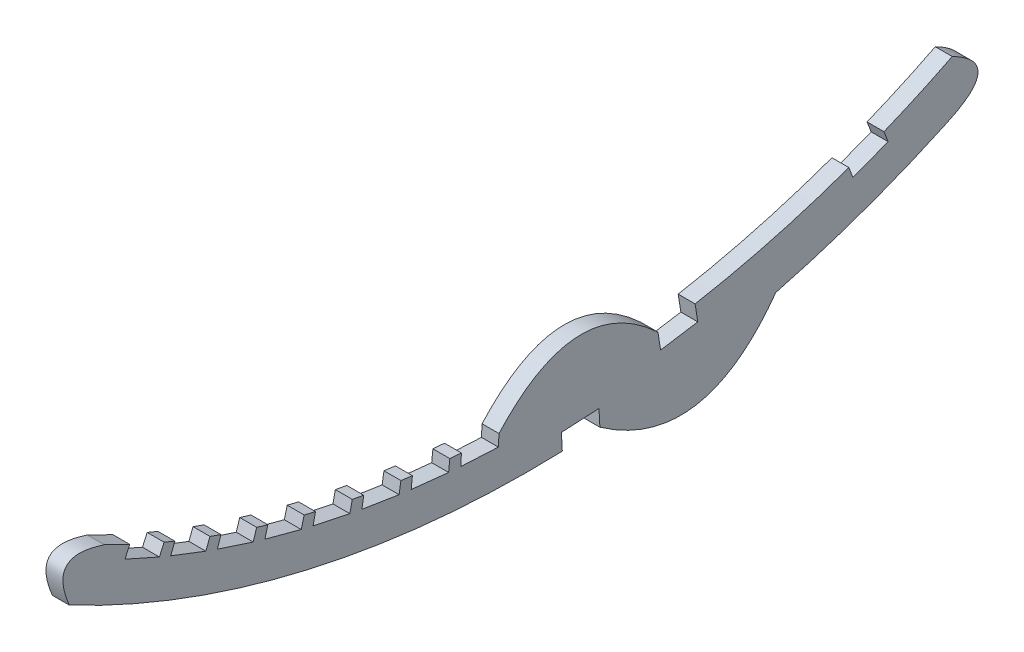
ISO-10303-21;
HEADER;
FILE_DESCRIPTION(('STEP AP214'),'2;1');
FILE_NAME('part.step','',(''),(''),'','','');
FILE_SCHEMA(('AUTOMOTIVE_DESIGN { 1 0 10303 214 1 1 1 1 }'));
ENDSEC;
DATA;
#1=APPLICATION_CONTEXT('core data for automotive mechanical design processes');
#2=APPLICATION_PROTOCOL_DEFINITION('international standard','automotive_design',2000,#1);
#3=PRODUCT_CONTEXT('',#1,'mechanical');
#4=PRODUCT('Part','Part','',(#3));
#5=PRODUCT_RELATED_PRODUCT_CATEGORY('part','',(#4));
#6=PRODUCT_DEFINITION_FORMATION('','',#4);
#7=PRODUCT_DEFINITION_CONTEXT('part definition',#1,'design');
#8=PRODUCT_DEFINITION('design','',#6,#7);
#9=PRODUCT_DEFINITION_SHAPE('','',#8);
#10=(LENGTH_UNIT() NAMED_UNIT(*) SI_UNIT(.MILLI.,.METRE.));
#11=(NAMED_UNIT(*) PLANE_ANGLE_UNIT() SI_UNIT($,.RADIAN.));
#12=(NAMED_UNIT(*) SI_UNIT($,.STERADIAN.) SOLID_ANGLE_UNIT());
#13=UNCERTAINTY_MEASURE_WITH_UNIT(LENGTH_MEASURE(1.E-05),#10,'distance_accuracy_value','');
#14=(GEOMETRIC_REPRESENTATION_CONTEXT(3) GLOBAL_UNCERTAINTY_ASSIGNED_CONTEXT((#13)) GLOBAL_UNIT_ASSIGNED_CONTEXT((#10,
#11,#12)) REPRESENTATION_CONTEXT('',''));
#15=CARTESIAN_POINT('',(0.,0.,0.));
#16=DIRECTION('',(0.,0.,1.));
#17=DIRECTION('',(1.,0.,0.));
#18=AXIS2_PLACEMENT_3D('',#15,#16,#17);
#19=CARTESIAN_POINT('',(18.,-892.011904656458,452.011904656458));
#20=CARTESIAN_POINT('',(18.,-871.781237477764,513.223066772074));
#21=CARTESIAN_POINT('',(18.,-929.119171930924,489.119171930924));
#22=B_SPLINE_CURVE_WITH_KNOTS('',2,(#19,#20,#21),.UNSPECIFIED.,.F.,.F.,(3,3),(0.,1.),.UNSPECIFIED.);
#23=DIRECTION('',(-1.,0.,0.));
#24=VECTOR('',#23,1.);
#25=SURFACE_OF_LINEAR_EXTRUSION('',#22,#24);
#26=CARTESIAN_POINT('',(0.,-892.011904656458,452.011904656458));
#27=CARTESIAN_POINT('',(0.,-871.781237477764,513.223066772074));
#28=CARTESIAN_POINT('',(0.,-929.119171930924,489.119171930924));
#29=B_SPLINE_CURVE_WITH_KNOTS('',2,(#26,#27,#28),.UNSPECIFIED.,.F.,.F.,(3,3),(0.,1.),.UNSPECIFIED.);
#30=CARTESIAN_POINT('',(0.,-892.011904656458,452.011904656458));
#31=VERTEX_POINT('',#30);
#32=CARTESIAN_POINT('',(0.,-929.119171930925,489.119171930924));
#33=VERTEX_POINT('',#32);
#34=EDGE_CURVE('E375',#31,#33,#29,.T.);
#35=ORIENTED_EDGE('',*,*,#34,.T.);
#36=DIRECTION('',(-1.,0.,0.));
#37=VECTOR('',#36,1.);
#38=CARTESIAN_POINT('',(18.,-929.119171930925,489.119171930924));
#39=LINE('',#38,#37);
#40=CARTESIAN_POINT('',(18.,-929.119171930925,489.119171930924));
#41=VERTEX_POINT('',#40);
#42=EDGE_CURVE('E11',#41,#33,#39,.T.);
#43=ORIENTED_EDGE('',*,*,#42,.F.);
#44=CARTESIAN_POINT('',(18.,-892.011904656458,452.011904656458));
#45=VERTEX_POINT('',#44);
#46=EDGE_CURVE('E504',#45,#41,#22,.T.);
#47=ORIENTED_EDGE('',*,*,#46,.F.);
#48=DIRECTION('',(-1.,0.,0.));
#49=VECTOR('',#48,1.);
#50=CARTESIAN_POINT('',(18.,-892.011904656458,452.011904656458));
#51=LINE('',#50,#49);
#52=EDGE_CURVE('E371',#45,#31,#51,.T.);
#53=ORIENTED_EDGE('',*,*,#52,.T.);
#54=EDGE_LOOP('',(#35,#43,#47,#53));
#55=FACE_BOUND('',#54,.T.);
#56=ADVANCED_FACE('F33',(#55),#25,.F.);
#57=CARTESIAN_POINT('',(18.,0.,0.));
#58=DIRECTION('',(-1.,0.,0.));
#59=DIRECTION('',(0.,0.,1.));
#60=AXIS2_PLACEMENT_3D('',#57,#58,#59);
#61=CYLINDRICAL_SURFACE('',#60,1050.);
#62=CARTESIAN_POINT('',(0.,0.,0.));
#63=DIRECTION('',(1.,0.,0.));
#64=DIRECTION('',(0.,0.,-1.));
#65=AXIS2_PLACEMENT_3D('',#62,#63,#64);
#66=CIRCLE('',#65,1050.);
#67=CARTESIAN_POINT('',(0.,-1049.4174982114,-34.970193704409));
#68=VERTEX_POINT('',#67);
#69=EDGE_CURVE('E380',#33,#68,#66,.T.);
#70=ORIENTED_EDGE('',*,*,#69,.T.);
#71=DIRECTION('',(-1.,0.,0.));
#72=VECTOR('',#71,1.);
#73=CARTESIAN_POINT('',(18.,-1049.4174982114,-34.970193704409));
#74=LINE('',#73,#72);
#75=CARTESIAN_POINT('',(18.,-1049.4174982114,-34.970193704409));
#76=VERTEX_POINT('',#75);
#77=EDGE_CURVE('E42',#76,#68,#74,.T.);
#78=ORIENTED_EDGE('',*,*,#77,.F.);
#79=CARTESIAN_POINT('',(18.,0.,0.));
#80=DIRECTION('',(1.,0.,0.));
#81=DIRECTION('',(0.,0.,-1.));
#82=AXIS2_PLACEMENT_3D('',#79,#80,#81);
#83=CIRCLE('',#82,1050.);
#84=EDGE_CURVE('E216',#41,#76,#83,.T.);
#85=ORIENTED_EDGE('',*,*,#84,.F.);
#86=ORIENTED_EDGE('',*,*,#42,.T.);
#87=EDGE_LOOP('',(#70,#78,#85,#86));
#88=FACE_BOUND('',#87,.T.);
#89=ADVANCED_FACE('F686',(#88),#61,.T.);
#90=CARTESIAN_POINT('',(18.,-1049.4174982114,-34.970193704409));
#91=DIRECTION('',(0.,-0.0523359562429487,0.998629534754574));
#92=DIRECTION('',(0.,-0.998629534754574,-0.0523359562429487));
#93=AXIS2_PLACEMENT_3D('',#90,#91,#92);
#94=PLANE('',#93);
#95=DIRECTION('',(0.,0.998629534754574,0.0523359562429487));
#96=VECTOR('',#95,1.);
#97=CARTESIAN_POINT('',(0.,-1049.4174982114,-34.970193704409));
#98=LINE('',#97,#96);
#99=CARTESIAN_POINT('',(0.,-1031.63239899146,-34.0381161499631));
#100=VERTEX_POINT('',#99);
#101=EDGE_CURVE('E385',#68,#100,#98,.T.);
#102=ORIENTED_EDGE('',*,*,#101,.T.);
#103=DIRECTION('',(-1.,0.,0.));
#104=VECTOR('',#103,1.);
#105=CARTESIAN_POINT('',(18.,-1031.63239899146,-34.0381161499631));
#106=LINE('',#105,#104);
#107=CARTESIAN_POINT('',(18.,-1031.63239899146,-34.0381161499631));
#108=VERTEX_POINT('',#107);
#109=EDGE_CURVE('E634',#108,#100,#106,.T.);
#110=ORIENTED_EDGE('',*,*,#109,.F.);
#111=DIRECTION('',(0.,0.998629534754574,0.0523359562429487));
#112=VECTOR('',#111,1.);
#113=CARTESIAN_POINT('',(18.,-1049.4174982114,-34.970193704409));
#114=LINE('',#113,#112);
#115=EDGE_CURVE('E642',#76,#108,#114,.T.);
#116=ORIENTED_EDGE('',*,*,#115,.F.);
#117=ORIENTED_EDGE('',*,*,#77,.T.);
#118=EDGE_LOOP('',(#102,#110,#116,#117));
#119=FACE_BOUND('',#118,.T.);
#120=ADVANCED_FACE('F640',(#119),#94,.F.);
#121=CARTESIAN_POINT('',(18.,-1030.58567986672,-54.0107068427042));
#122=DIRECTION('',(0.,0.998629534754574,0.0523359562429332));
#123=DIRECTION('',(0.,-0.0523359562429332,0.998629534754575));
#124=AXIS2_PLACEMENT_3D('',#121,#122,#123);
#125=PLANE('',#124);
#126=DIRECTION('',(0.,0.0523359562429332,-0.998629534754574));
#127=VECTOR('',#126,1.);
#128=CARTESIAN_POINT('',(0.,-1030.58567986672,-54.0107068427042));
#129=LINE('',#128,#127);
#130=CARTESIAN_POINT('',(0.,-1029.53896074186,-73.9832975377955));
#131=VERTEX_POINT('',#130);
#132=EDGE_CURVE('E388',#100,#131,#129,.T.);
#133=ORIENTED_EDGE('',*,*,#132,.T.);
#134=DIRECTION('',(-1.,0.,0.));
#135=VECTOR('',#134,1.);
#136=CARTESIAN_POINT('',(18.,-1029.53896074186,-73.9832975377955));
#137=LINE('',#136,#135);
#138=CARTESIAN_POINT('',(18.,-1029.53896074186,-73.9832975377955));
#139=VERTEX_POINT('',#138);
#140=EDGE_CURVE('E631',#139,#131,#137,.T.);
#141=ORIENTED_EDGE('',*,*,#140,.F.);
#142=DIRECTION('',(0.,0.0523359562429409,-0.998629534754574));
#143=VECTOR('',#142,1.);
#144=CARTESIAN_POINT('',(18.,-1031.63239899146,-34.0381161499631));
#145=LINE('',#144,#143);
#146=EDGE_CURVE('E659',#108,#139,#145,.T.);
#147=ORIENTED_EDGE('',*,*,#146,.F.);
#148=ORIENTED_EDGE('',*,*,#109,.T.);
#149=EDGE_LOOP('',(#133,#141,#147,#148));
#150=FACE_BOUND('',#149,.T.);
#151=ADVANCED_FACE('F650',(#150),#125,.F.);
#152=CARTESIAN_POINT('',(18.,-1047.32405996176,-74.9153750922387));
#153=DIRECTION('',(0.,0.0523359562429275,-0.998629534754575));
#154=DIRECTION('',(0.,0.998629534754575,0.0523359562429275));
#155=AXIS2_PLACEMENT_3D('',#152,#153,#154);
#156=PLANE('',#155);
#157=DIRECTION('',(0.,-0.998629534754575,-0.0523359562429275));
#158=VECTOR('',#157,1.);
#159=CARTESIAN_POINT('',(0.,-1047.32405996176,-74.9153750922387));
#160=LINE('',#159,#158);
#161=CARTESIAN_POINT('',(0.,-1047.32405996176,-74.9153750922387));
#162=VERTEX_POINT('',#161);
#163=EDGE_CURVE('E390',#131,#162,#160,.T.);
#164=ORIENTED_EDGE('',*,*,#163,.T.);
#165=DIRECTION('',(-1.,0.,0.));
#166=VECTOR('',#165,1.);
#167=CARTESIAN_POINT('',(18.,-1047.32405996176,-74.9153750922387));
#168=LINE('',#167,#166);
#169=CARTESIAN_POINT('',(18.,-1047.32405996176,-74.9153750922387));
#170=VERTEX_POINT('',#169);
#171=EDGE_CURVE('E628',#170,#162,#168,.T.);
#172=ORIENTED_EDGE('',*,*,#171,.F.);
#173=DIRECTION('',(0.,-0.998629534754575,-0.0523359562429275));
#174=VECTOR('',#173,1.);
#175=CARTESIAN_POINT('',(18.,-1047.32405996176,-74.9153750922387));
#176=LINE('',#175,#174);
#177=EDGE_CURVE('E656',#139,#170,#176,.T.);
#178=ORIENTED_EDGE('',*,*,#177,.F.);
#179=ORIENTED_EDGE('',*,*,#140,.T.);
#180=EDGE_LOOP('',(#164,#172,#178,#179));
#181=FACE_BOUND('',#180,.T.);
#182=ADVANCED_FACE('F654',(#181),#156,.F.);
#183=CARTESIAN_POINT('',(18.,-1047.32405996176,-74.9153750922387));
#184=CARTESIAN_POINT('',(18.,-1124.14994039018,-184.66822318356));
#185=CARTESIAN_POINT('',(18.,-1016.81352375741,-261.897418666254));
#186=B_SPLINE_CURVE_WITH_KNOTS('',2,(#183,#184,#185),.UNSPECIFIED.,.F.,.F.,(3,3),(0.,1.),.UNSPECIFIED.);
#187=DIRECTION('',(-1.,0.,0.));
#188=VECTOR('',#187,1.);
#189=SURFACE_OF_LINEAR_EXTRUSION('',#186,#188);
#190=CARTESIAN_POINT('',(0.,-1047.32405996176,-74.9153750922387));
#191=CARTESIAN_POINT('',(0.,-1124.14994039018,-184.66822318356));
#192=CARTESIAN_POINT('',(0.,-1016.81352375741,-261.897418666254));
#193=B_SPLINE_CURVE_WITH_KNOTS('',2,(#190,#191,#192),.UNSPECIFIED.,.F.,.F.,(3,3),(0.,1.),.UNSPECIFIED.);
#194=CARTESIAN_POINT('',(0.,-1016.81352375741,-261.897418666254));
#195=VERTEX_POINT('',#194);
#196=EDGE_CURVE('E392',#162,#195,#193,.T.);
#197=ORIENTED_EDGE('',*,*,#196,.T.);
#198=DIRECTION('',(-1.,0.,0.));
#199=VECTOR('',#198,1.);
#200=CARTESIAN_POINT('',(18.,-1016.81352375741,-261.897418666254));
#201=LINE('',#200,#199);
#202=CARTESIAN_POINT('',(18.,-1016.81352375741,-261.897418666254));
#203=VERTEX_POINT('',#202);
#204=EDGE_CURVE('E625',#203,#195,#201,.T.);
#205=ORIENTED_EDGE('',*,*,#204,.F.);
#206=EDGE_CURVE('E658',#170,#203,#186,.T.);
#207=ORIENTED_EDGE('',*,*,#206,.F.);
#208=ORIENTED_EDGE('',*,*,#171,.T.);
#209=EDGE_LOOP('',(#197,#205,#207,#208));
#210=FACE_BOUND('',#209,.T.);
#211=ADVANCED_FACE('F674',(#210),#189,.F.);
#212=CARTESIAN_POINT('',(18.,0.,0.));
#213=DIRECTION('',(-1.,0.,0.));
#214=DIRECTION('',(0.,0.,1.));
#215=AXIS2_PLACEMENT_3D('',#212,#213,#214);
#216=CYLINDRICAL_SURFACE('',#215,1050.);
#217=CARTESIAN_POINT('',(0.,0.,0.));
#218=DIRECTION('',(1.,0.,0.));
#219=DIRECTION('',(0.,0.,-1.));
#220=AXIS2_PLACEMENT_3D('',#217,#218,#219);
#221=CIRCLE('',#220,1050.);
#222=CARTESIAN_POINT('',(0.,-953.199433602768,-440.353085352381));
#223=VERTEX_POINT('',#222);
#224=EDGE_CURVE('E396',#195,#223,#221,.T.);
#225=ORIENTED_EDGE('',*,*,#224,.T.);
#226=DIRECTION('',(-1.,0.,0.));
#227=VECTOR('',#226,1.);
#228=CARTESIAN_POINT('',(18.,-953.199433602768,-440.353085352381));
#229=LINE('',#228,#227);
#230=CARTESIAN_POINT('',(18.,-953.199433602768,-440.353085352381));
#231=VERTEX_POINT('',#230);
#232=EDGE_CURVE('E622',#231,#223,#229,.T.);
#233=ORIENTED_EDGE('',*,*,#232,.F.);
#234=CARTESIAN_POINT('',(18.,0.,0.));
#235=DIRECTION('',(1.,0.,0.));
#236=DIRECTION('',(0.,0.,-1.));
#237=AXIS2_PLACEMENT_3D('',#234,#235,#236);
#238=CIRCLE('',#237,1050.);
#239=EDGE_CURVE('E661',#203,#231,#238,.T.);
#240=ORIENTED_EDGE('',*,*,#239,.F.);
#241=ORIENTED_EDGE('',*,*,#204,.T.);
#242=EDGE_LOOP('',(#225,#233,#240,#241));
#243=FACE_BOUND('',#242,.T.);
#244=ADVANCED_FACE('F678',(#243),#216,.T.);
#245=CARTESIAN_POINT('',(18.,-953.199433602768,-440.353085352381));
#246=CARTESIAN_POINT('',(18.,-923.508361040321,-508.567576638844));
#247=CARTESIAN_POINT('',(18.,-893.280722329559,-449.499222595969));
#248=B_SPLINE_CURVE_WITH_KNOTS('',2,(#245,#246,#247),.UNSPECIFIED.,.F.,.F.,(3,3),(0.,1.),.UNSPECIFIED.);
#249=DIRECTION('',(-1.,0.,0.));
#250=VECTOR('',#249,1.);
#251=SURFACE_OF_LINEAR_EXTRUSION('',#248,#250);
#252=CARTESIAN_POINT('',(0.,-953.199433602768,-440.353085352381));
#253=CARTESIAN_POINT('',(0.,-923.508361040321,-508.567576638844));
#254=CARTESIAN_POINT('',(0.,-893.280722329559,-449.499222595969));
#255=B_SPLINE_CURVE_WITH_KNOTS('',2,(#252,#253,#254),.UNSPECIFIED.,.F.,.F.,(3,3),(0.,1.),.UNSPECIFIED.);
#256=CARTESIAN_POINT('',(0.,-893.280722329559,-449.499222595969));
#257=VERTEX_POINT('',#256);
#258=EDGE_CURVE('E401',#223,#257,#255,.T.);
#259=ORIENTED_EDGE('',*,*,#258,.T.);
#260=DIRECTION('',(-1.,0.,0.));
#261=VECTOR('',#260,1.);
#262=CARTESIAN_POINT('',(18.,-893.280722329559,-449.499222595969));
#263=LINE('',#262,#261);
#264=CARTESIAN_POINT('',(18.,-893.280722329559,-449.499222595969));
#265=VERTEX_POINT('',#264);
#266=EDGE_CURVE('E619',#265,#257,#263,.T.);
#267=ORIENTED_EDGE('',*,*,#266,.F.);
#268=EDGE_CURVE('E914',#231,#265,#248,.T.);
#269=ORIENTED_EDGE('',*,*,#268,.F.);
#270=ORIENTED_EDGE('',*,*,#232,.T.);
#271=EDGE_LOOP('',(#259,#267,#269,#270));
#272=FACE_BOUND('',#271,.T.);
#273=ADVANCED_FACE('F913',(#272),#251,.F.);
#274=CARTESIAN_POINT('',(18.,0.,0.));
#275=DIRECTION('',(-1.,0.,0.));
#276=DIRECTION('',(0.,0.,1.));
#277=AXIS2_PLACEMENT_3D('',#274,#275,#276);
#278=CYLINDRICAL_SURFACE('',#277,1000.);
#279=CARTESIAN_POINT('',(0.,0.,0.));
#280=DIRECTION('',(-1.,0.,0.));
#281=DIRECTION('',(0.,0.,-1.));
#282=AXIS2_PLACEMENT_3D('',#279,#280,#281);
#283=CIRCLE('',#282,1000.);
#284=CARTESIAN_POINT('',(0.,-926.226332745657,-376.967877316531));
#285=VERTEX_POINT('',#284);
#286=EDGE_CURVE('E405',#257,#285,#283,.T.);
#287=ORIENTED_EDGE('',*,*,#286,.T.);
#288=DIRECTION('',(-1.,0.,0.));
#289=VECTOR('',#288,1.);
#290=CARTESIAN_POINT('',(18.,-926.226332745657,-376.967877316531));
#291=LINE('',#290,#289);
#292=CARTESIAN_POINT('',(18.,-926.226332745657,-376.967877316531));
#293=VERTEX_POINT('',#292);
#294=EDGE_CURVE('E616',#293,#285,#291,.T.);
#295=ORIENTED_EDGE('',*,*,#294,.F.);
#296=CARTESIAN_POINT('',(18.,0.,0.));
#297=DIRECTION('',(-1.,0.,0.));
#298=DIRECTION('',(0.,0.,-1.));
#299=AXIS2_PLACEMENT_3D('',#296,#297,#298);
#300=CIRCLE('',#299,1000.);
#301=EDGE_CURVE('E910',#265,#293,#300,.T.);
#302=ORIENTED_EDGE('',*,*,#301,.F.);
#303=ORIENTED_EDGE('',*,*,#266,.T.);
#304=EDGE_LOOP('',(#287,#295,#302,#303));
#305=FACE_BOUND('',#304,.T.);
#306=ADVANCED_FACE('F907',(#305),#278,.F.);
#307=CARTESIAN_POINT('',(18.,-937.616032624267,-381.339973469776));
#308=DIRECTION('',(0.,0.358367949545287,-0.933580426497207));
#309=DIRECTION('',(0.,0.933580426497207,0.358367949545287));
#310=AXIS2_PLACEMENT_3D('',#307,#308,#309);
#311=PLANE('',#310);
#312=DIRECTION('',(0.,-0.933580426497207,-0.358367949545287));
#313=VECTOR('',#312,1.);
#314=CARTESIAN_POINT('',(0.,-937.616032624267,-381.339973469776));
#315=LINE('',#314,#313);
#316=CARTESIAN_POINT('',(0.,-937.616032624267,-381.339973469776));
#317=VERTEX_POINT('',#316);
#318=EDGE_CURVE('E410',#285,#317,#315,.T.);
#319=ORIENTED_EDGE('',*,*,#318,.T.);
#320=DIRECTION('',(-1.,0.,0.));
#321=VECTOR('',#320,1.);
#322=CARTESIAN_POINT('',(18.,-937.616032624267,-381.339973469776));
#323=LINE('',#322,#321);
#324=CARTESIAN_POINT('',(18.,-937.616032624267,-381.339973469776));
#325=VERTEX_POINT('',#324);
#326=EDGE_CURVE('E613',#325,#317,#323,.T.);
#327=ORIENTED_EDGE('',*,*,#326,.F.);
#328=DIRECTION('',(0.,-0.933580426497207,-0.358367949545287));
#329=VECTOR('',#328,1.);
#330=CARTESIAN_POINT('',(18.,-937.616032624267,-381.339973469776));
#331=LINE('',#330,#329);
#332=EDGE_CURVE('E901',#293,#325,#331,.T.);
#333=ORIENTED_EDGE('',*,*,#332,.F.);
#334=ORIENTED_EDGE('',*,*,#294,.T.);
#335=EDGE_LOOP('',(#319,#327,#333,#334));
#336=FACE_BOUND('',#335,.T.);
#337=ADVANCED_FACE('F900',(#336),#311,.F.);
#338=CARTESIAN_POINT('',(18.,-951.950750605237,-343.996756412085));
#339=DIRECTION('',(0.,-0.933580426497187,-0.358367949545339));
#340=DIRECTION('',(0.,0.358367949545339,-0.933580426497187));
#341=AXIS2_PLACEMENT_3D('',#338,#339,#340);
#342=PLANE('',#341);
#343=DIRECTION('',(0.,-0.358367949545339,0.933580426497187));
#344=VECTOR('',#343,1.);
#345=CARTESIAN_POINT('',(0.,-951.950750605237,-343.996756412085));
#346=LINE('',#345,#344);
#347=CARTESIAN_POINT('',(0.,-951.950750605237,-343.996756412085));
#348=VERTEX_POINT('',#347);
#349=EDGE_CURVE('E413',#317,#348,#346,.T.);
#350=ORIENTED_EDGE('',*,*,#349,.T.);
#351=DIRECTION('',(-1.,0.,0.));
#352=VECTOR('',#351,1.);
#353=CARTESIAN_POINT('',(18.,-951.950750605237,-343.996756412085));
#354=LINE('',#353,#352);
#355=CARTESIAN_POINT('',(18.,-951.950750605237,-343.996756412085));
#356=VERTEX_POINT('',#355);
#357=EDGE_CURVE('E610',#356,#348,#354,.T.);
#358=ORIENTED_EDGE('',*,*,#357,.F.);
#359=DIRECTION('',(0.,-0.358367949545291,0.933580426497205));
#360=VECTOR('',#359,1.);
#361=CARTESIAN_POINT('',(18.,-944.783391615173,-362.668364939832));
#362=LINE('',#361,#360);
#363=EDGE_CURVE('E896',#325,#356,#362,.T.);
#364=ORIENTED_EDGE('',*,*,#363,.F.);
#365=ORIENTED_EDGE('',*,*,#326,.T.);
#366=EDGE_LOOP('',(#350,#358,#364,#365));
#367=FACE_BOUND('',#366,.T.);
#368=ADVANCED_FACE('F895',(#367),#342,.F.);
#369=CARTESIAN_POINT('',(18.,-951.950750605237,-343.996756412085));
#370=DIRECTION('',(0.,-0.358367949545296,0.933580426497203));
#371=DIRECTION('',(0.,-0.933580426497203,-0.358367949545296));
#372=AXIS2_PLACEMENT_3D('',#369,#370,#371);
#373=PLANE('',#372);
#374=DIRECTION('',(0.,0.933580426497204,0.358367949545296));
#375=VECTOR('',#374,1.);
#376=CARTESIAN_POINT('',(0.,-951.950750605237,-343.996756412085));
#377=LINE('',#376,#375);
#378=CARTESIAN_POINT('',(0.,-940.56105072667,-339.624660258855));
#379=VERTEX_POINT('',#378);
#380=EDGE_CURVE('E415',#348,#379,#377,.T.);
#381=ORIENTED_EDGE('',*,*,#380,.T.);
#382=DIRECTION('',(-1.,0.,0.));
#383=VECTOR('',#382,1.);
#384=CARTESIAN_POINT('',(18.,-940.56105072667,-339.624660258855));
#385=LINE('',#384,#383);
#386=CARTESIAN_POINT('',(18.,-940.56105072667,-339.624660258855));
#387=VERTEX_POINT('',#386);
#388=EDGE_CURVE('E607',#387,#379,#385,.T.);
#389=ORIENTED_EDGE('',*,*,#388,.F.);
#390=DIRECTION('',(0.,0.933580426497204,0.358367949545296));
#391=VECTOR('',#390,1.);
#392=CARTESIAN_POINT('',(18.,-951.950750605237,-343.996756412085));
#393=LINE('',#392,#391);
#394=EDGE_CURVE('E892',#356,#387,#393,.T.);
#395=ORIENTED_EDGE('',*,*,#394,.F.);
#396=ORIENTED_EDGE('',*,*,#357,.T.);
#397=EDGE_LOOP('',(#381,#389,#395,#396));
#398=FACE_BOUND('',#397,.T.);
#399=ADVANCED_FACE('F889',(#398),#373,.F.);
#400=CARTESIAN_POINT('',(18.,0.,0.));
#401=DIRECTION('',(-1.,0.,0.));
#402=DIRECTION('',(0.,0.,1.));
#403=AXIS2_PLACEMENT_3D('',#400,#401,#402);
#404=CYLINDRICAL_SURFACE('',#403,1000.);
#405=CARTESIAN_POINT('',(0.,0.,0.));
#406=DIRECTION('',(-1.,0.,0.));
#407=DIRECTION('',(0.,0.,-1.));
#408=AXIS2_PLACEMENT_3D('',#405,#406,#407);
#409=CIRCLE('',#408,1000.);
#410=CARTESIAN_POINT('',(0.,-984.362093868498,-176.156941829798));
#411=VERTEX_POINT('',#410);
#412=EDGE_CURVE('E417',#379,#411,#409,.T.);
#413=ORIENTED_EDGE('',*,*,#412,.T.);
#414=DIRECTION('',(-1.,0.,0.));
#415=VECTOR('',#414,1.);
#416=CARTESIAN_POINT('',(18.,-984.362093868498,-176.156941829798));
#417=LINE('',#416,#415);
#418=CARTESIAN_POINT('',(18.,-984.362093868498,-176.156941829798));
#419=VERTEX_POINT('',#418);
#420=EDGE_CURVE('E604',#419,#411,#417,.T.);
#421=ORIENTED_EDGE('',*,*,#420,.F.);
#422=CARTESIAN_POINT('',(18.,0.,0.));
#423=DIRECTION('',(-1.,0.,0.));
#424=DIRECTION('',(0.,0.,-1.));
#425=AXIS2_PLACEMENT_3D('',#422,#423,#424);
#426=CIRCLE('',#425,1000.);
#427=EDGE_CURVE('E884',#387,#419,#426,.T.);
#428=ORIENTED_EDGE('',*,*,#427,.F.);
#429=ORIENTED_EDGE('',*,*,#388,.T.);
#430=EDGE_LOOP('',(#413,#421,#428,#429));
#431=FACE_BOUND('',#430,.T.);
#432=ADVANCED_FACE('F883',(#431),#404,.F.);
#433=CARTESIAN_POINT('',(18.,-996.411911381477,-178.065445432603));
#434=DIRECTION('',(0.,0.15643446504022,-0.987688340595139));
#435=DIRECTION('',(0.,0.987688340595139,0.15643446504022));
#436=AXIS2_PLACEMENT_3D('',#433,#434,#435);
#437=PLANE('',#436);
#438=DIRECTION('',(0.,-0.987688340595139,-0.15643446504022));
#439=VECTOR('',#438,1.);
#440=CARTESIAN_POINT('',(0.,-996.411911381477,-178.065445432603));
#441=LINE('',#440,#439);
#442=CARTESIAN_POINT('',(0.,-1002.33804142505,-179.004052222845));
#443=VERTEX_POINT('',#442);
#444=EDGE_CURVE('E420',#411,#443,#441,.T.);
#445=ORIENTED_EDGE('',*,*,#444,.T.);
#446=DIRECTION('',(-1.,0.,0.));
#447=VECTOR('',#446,1.);
#448=CARTESIAN_POINT('',(18.,-1002.33804142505,-179.004052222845));
#449=LINE('',#448,#447);
#450=CARTESIAN_POINT('',(18.,-1002.33804142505,-179.004052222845));
#451=VERTEX_POINT('',#450);
#452=EDGE_CURVE('E601',#451,#443,#449,.T.);
#453=ORIENTED_EDGE('',*,*,#452,.F.);
#454=DIRECTION('',(0.,-0.98768834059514,-0.156434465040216));
#455=VECTOR('',#454,1.);
#456=CARTESIAN_POINT('',(18.,-996.411911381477,-178.065445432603));
#457=LINE('',#456,#455);
#458=EDGE_CURVE('E880',#419,#451,#457,.T.);
#459=ORIENTED_EDGE('',*,*,#458,.F.);
#460=ORIENTED_EDGE('',*,*,#420,.T.);
#461=EDGE_LOOP('',(#445,#453,#459,#460));
#462=FACE_BOUND('',#461,.T.);
#463=ADVANCED_FACE('F877',(#462),#437,.F.);
#464=CARTESIAN_POINT('',(18.,-1008.59542002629,-139.496518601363));
#465=DIRECTION('',(0.,-0.987688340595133,-0.156434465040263));
#466=DIRECTION('',(0.,0.156434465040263,-0.987688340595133));
#467=AXIS2_PLACEMENT_3D('',#464,#465,#466);
#468=PLANE('',#467);
#469=DIRECTION('',(0.,-0.156434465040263,0.987688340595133));
#470=VECTOR('',#469,1.);
#471=CARTESIAN_POINT('',(0.,-1008.59542002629,-139.496518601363));
#472=LINE('',#471,#470);
#473=CARTESIAN_POINT('',(0.,-1008.59542002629,-139.496518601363));
#474=VERTEX_POINT('',#473);
#475=EDGE_CURVE('E423',#443,#474,#472,.T.);
#476=ORIENTED_EDGE('',*,*,#475,.T.);
#477=DIRECTION('',(-1.,0.,0.));
#478=VECTOR('',#477,1.);
#479=CARTESIAN_POINT('',(18.,-1008.59542002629,-139.496518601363));
#480=LINE('',#479,#478);
#481=CARTESIAN_POINT('',(18.,-1008.59542002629,-139.496518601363));
#482=VERTEX_POINT('',#481);
#483=EDGE_CURVE('E598',#482,#474,#480,.T.);
#484=ORIENTED_EDGE('',*,*,#483,.F.);
#485=DIRECTION('',(0.,-0.156434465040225,0.987688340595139));
#486=VECTOR('',#485,1.);
#487=CARTESIAN_POINT('',(18.,-1005.46673072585,-159.250285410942));
#488=LINE('',#487,#486);
#489=EDGE_CURVE('E873',#451,#482,#488,.T.);
#490=ORIENTED_EDGE('',*,*,#489,.F.);
#491=ORIENTED_EDGE('',*,*,#452,.T.);
#492=EDGE_LOOP('',(#476,#484,#490,#491));
#493=FACE_BOUND('',#492,.T.);
#494=ADVANCED_FACE('F872',(#493),#468,.F.);
#495=CARTESIAN_POINT('',(18.,-1002.66928998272,-138.557911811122));
#496=DIRECTION('',(0.,-0.156434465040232,0.987688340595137));
#497=DIRECTION('',(0.,-0.987688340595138,-0.156434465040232));
#498=AXIS2_PLACEMENT_3D('',#495,#496,#497);
#499=PLANE('',#498);
#500=DIRECTION('',(0.,0.987688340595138,0.156434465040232));
#501=VECTOR('',#500,1.);
#502=CARTESIAN_POINT('',(0.,-1002.66928998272,-138.557911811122));
#503=LINE('',#502,#501);
#504=CARTESIAN_POINT('',(0.,-990.619472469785,-136.649408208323));
#505=VERTEX_POINT('',#504);
#506=EDGE_CURVE('E426',#474,#505,#503,.T.);
#507=ORIENTED_EDGE('',*,*,#506,.T.);
#508=DIRECTION('',(-1.,0.,0.));
#509=VECTOR('',#508,1.);
#510=CARTESIAN_POINT('',(18.,-990.619472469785,-136.649408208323));
#511=LINE('',#510,#509);
#512=CARTESIAN_POINT('',(18.,-990.619472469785,-136.649408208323));
#513=VERTEX_POINT('',#512);
#514=EDGE_CURVE('E595',#513,#505,#511,.T.);
#515=ORIENTED_EDGE('',*,*,#514,.F.);
#516=DIRECTION('',(0.,0.987688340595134,0.156434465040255));
#517=VECTOR('',#516,1.);
#518=CARTESIAN_POINT('',(18.,-1002.66928998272,-138.557911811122));
#519=LINE('',#518,#517);
#520=EDGE_CURVE('E868',#482,#513,#519,.T.);
#521=ORIENTED_EDGE('',*,*,#520,.F.);
#522=ORIENTED_EDGE('',*,*,#483,.T.);
#523=EDGE_LOOP('',(#507,#515,#521,#522));
#524=FACE_BOUND('',#523,.T.);
#525=ADVANCED_FACE('F867',(#524),#499,.F.);
#526=CARTESIAN_POINT('',(18.,-990.619472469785,-136.649408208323));
#527=CARTESIAN_POINT('',(18.,-909.067419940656,-49.3351598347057));
#528=CARTESIAN_POINT('',(18.,-999.476507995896,32.3528973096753));
#529=B_SPLINE_CURVE_WITH_KNOTS('',2,(#526,#527,#528),.UNSPECIFIED.,.F.,.F.,(3,3),(0.,1.),.UNSPECIFIED.);
#530=DIRECTION('',(-1.,0.,0.));
#531=VECTOR('',#530,1.);
#532=SURFACE_OF_LINEAR_EXTRUSION('',#529,#531);
#533=CARTESIAN_POINT('',(0.,-990.619472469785,-136.649408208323));
#534=CARTESIAN_POINT('',(0.,-909.067419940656,-49.3351598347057));
#535=CARTESIAN_POINT('',(0.,-999.476507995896,32.3528973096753));
#536=B_SPLINE_CURVE_WITH_KNOTS('',2,(#533,#534,#535),.UNSPECIFIED.,.F.,.F.,(3,3),(0.,1.),.UNSPECIFIED.);
#537=CARTESIAN_POINT('',(0.,-999.476507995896,32.3528973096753));
#538=VERTEX_POINT('',#537);
#539=EDGE_CURVE('E428',#505,#538,#536,.T.);
#540=ORIENTED_EDGE('',*,*,#539,.T.);
#541=DIRECTION('',(-1.,0.,0.));
#542=VECTOR('',#541,1.);
#543=CARTESIAN_POINT('',(18.,-999.476507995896,32.3528973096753));
#544=LINE('',#543,#542);
#545=CARTESIAN_POINT('',(18.,-999.476507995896,32.3528973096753));
#546=VERTEX_POINT('',#545);
#547=EDGE_CURVE('E592',#546,#538,#544,.T.);
#548=ORIENTED_EDGE('',*,*,#547,.F.);
#549=EDGE_CURVE('E864',#513,#546,#529,.T.);
#550=ORIENTED_EDGE('',*,*,#549,.F.);
#551=ORIENTED_EDGE('',*,*,#514,.T.);
#552=EDGE_LOOP('',(#540,#548,#550,#551));
#553=FACE_BOUND('',#552,.T.);
#554=ADVANCED_FACE('F861',(#553),#532,.F.);
#555=CARTESIAN_POINT('',(18.,-1011.65980829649,32.9913970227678));
#556=DIRECTION('',(0.,-0.0523359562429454,-0.998629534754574));
#557=DIRECTION('',(0.,0.998629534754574,-0.0523359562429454));
#558=AXIS2_PLACEMENT_3D('',#555,#556,#557);
#559=PLANE('',#558);
#560=DIRECTION('',(0.,-0.998629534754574,0.0523359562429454));
#561=VECTOR('',#560,1.);
#562=CARTESIAN_POINT('',(0.,-1011.65980829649,32.9913970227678));
#563=LINE('',#562,#561);
#564=CARTESIAN_POINT('',(0.,-1011.65980829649,32.9913970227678));
#565=VERTEX_POINT('',#564);
#566=EDGE_CURVE('E432',#538,#565,#563,.T.);
#567=ORIENTED_EDGE('',*,*,#566,.T.);
#568=DIRECTION('',(-1.,0.,0.));
#569=VECTOR('',#568,1.);
#570=CARTESIAN_POINT('',(18.,-1011.65980829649,32.9913970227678));
#571=LINE('',#570,#569);
#572=CARTESIAN_POINT('',(18.,-1011.65980829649,32.9913970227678));
#573=VERTEX_POINT('',#572);
#574=EDGE_CURVE('E589',#573,#565,#571,.T.);
#575=ORIENTED_EDGE('',*,*,#574,.F.);
#576=DIRECTION('',(0.,-0.998629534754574,0.0523359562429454));
#577=VECTOR('',#576,1.);
#578=CARTESIAN_POINT('',(18.,-1011.65980829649,32.9913970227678));
#579=LINE('',#578,#577);
#580=EDGE_CURVE('E857',#546,#573,#579,.T.);
#581=ORIENTED_EDGE('',*,*,#580,.F.);
#582=ORIENTED_EDGE('',*,*,#547,.T.);
#583=EDGE_LOOP('',(#567,#575,#581,#582));
#584=FACE_BOUND('',#583,.T.);
#585=ADVANCED_FACE('F856',(#584),#559,.F.);
#586=CARTESIAN_POINT('',(18.,-1009.56637004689,72.9365784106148));
#587=DIRECTION('',(0.,-0.998629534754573,0.0523359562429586));
#588=DIRECTION('',(0.,-0.0523359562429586,-0.998629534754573));
#589=AXIS2_PLACEMENT_3D('',#586,#587,#588);
#590=PLANE('',#589);
#591=DIRECTION('',(0.,0.0523359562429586,0.998629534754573));
#592=VECTOR('',#591,1.);
#593=CARTESIAN_POINT('',(0.,-1009.56637004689,72.9365784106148));
#594=LINE('',#593,#592);
#595=CARTESIAN_POINT('',(0.,-1009.56637004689,72.9365784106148));
#596=VERTEX_POINT('',#595);
#597=EDGE_CURVE('E438',#565,#596,#594,.T.);
#598=ORIENTED_EDGE('',*,*,#597,.T.);
#599=DIRECTION('',(-1.,0.,0.));
#600=VECTOR('',#599,1.);
#601=CARTESIAN_POINT('',(18.,-1009.56637004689,72.9365784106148));
#602=LINE('',#601,#600);
#603=CARTESIAN_POINT('',(18.,-1009.56637004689,72.9365784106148));
#604=VERTEX_POINT('',#603);
#605=EDGE_CURVE('E586',#604,#596,#602,.T.);
#606=ORIENTED_EDGE('',*,*,#605,.F.);
#607=DIRECTION('',(0.,0.0523359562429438,0.998629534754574));
#608=VECTOR('',#607,1.);
#609=CARTESIAN_POINT('',(18.,-1010.61308917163,52.9639877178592));
#610=LINE('',#609,#608);
#611=EDGE_CURVE('E852',#573,#604,#610,.T.);
#612=ORIENTED_EDGE('',*,*,#611,.F.);
#613=ORIENTED_EDGE('',*,*,#574,.T.);
#614=EDGE_LOOP('',(#598,#606,#612,#613));
#615=FACE_BOUND('',#614,.T.);
#616=ADVANCED_FACE('F851',(#615),#590,.F.);
#617=CARTESIAN_POINT('',(18.,-1009.56637004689,72.9365784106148));
#618=DIRECTION('',(0.,0.0523359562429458,0.998629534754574));
#619=DIRECTION('',(0.,-0.998629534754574,0.0523359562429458));
#620=AXIS2_PLACEMENT_3D('',#617,#618,#619);
#621=PLANE('',#620);
#622=DIRECTION('',(0.,0.998629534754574,-0.0523359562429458));
#623=VECTOR('',#622,1.);
#624=CARTESIAN_POINT('',(0.,-1009.56637004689,72.9365784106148));
#625=LINE('',#624,#623);
#626=CARTESIAN_POINT('',(0.,-997.383069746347,72.2980786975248));
#627=VERTEX_POINT('',#626);
#628=EDGE_CURVE('E440',#596,#627,#625,.T.);
#629=ORIENTED_EDGE('',*,*,#628,.T.);
#630=DIRECTION('',(-1.,0.,0.));
#631=VECTOR('',#630,1.);
#632=CARTESIAN_POINT('',(18.,-997.383069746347,72.2980786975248));
#633=LINE('',#632,#631);
#634=CARTESIAN_POINT('',(18.,-997.383069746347,72.2980786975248));
#635=VERTEX_POINT('',#634);
#636=EDGE_CURVE('E583',#635,#627,#633,.T.);
#637=ORIENTED_EDGE('',*,*,#636,.F.);
#638=DIRECTION('',(0.,0.998629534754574,-0.0523359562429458));
#639=VECTOR('',#638,1.);
#640=CARTESIAN_POINT('',(18.,-1009.56637004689,72.9365784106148));
#641=LINE('',#640,#639);
#642=EDGE_CURVE('E848',#604,#635,#641,.T.);
#643=ORIENTED_EDGE('',*,*,#642,.F.);
#644=ORIENTED_EDGE('',*,*,#605,.T.);
#645=EDGE_LOOP('',(#629,#637,#643,#644));
#646=FACE_BOUND('',#645,.T.);
#647=ADVANCED_FACE('F845',(#646),#621,.F.);
#648=CARTESIAN_POINT('',(18.,0.,0.));
#649=DIRECTION('',(-1.,0.,0.));
#650=DIRECTION('',(0.,0.,1.));
#651=AXIS2_PLACEMENT_3D('',#648,#649,#650);
#652=CYLINDRICAL_SURFACE('',#651,1000.);
#653=CARTESIAN_POINT('',(0.,0.,0.));
#654=DIRECTION('',(-1.,0.,0.));
#655=DIRECTION('',(0.,0.,-1.));
#656=AXIS2_PLACEMENT_3D('',#653,#654,#655);
#657=CIRCLE('',#656,1000.);
#658=CARTESIAN_POINT('',(0.,-996.413540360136,84.6171175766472));
#659=VERTEX_POINT('',#658);
#660=EDGE_CURVE('E442',#627,#659,#657,.T.);
#661=ORIENTED_EDGE('',*,*,#660,.T.);
#662=DIRECTION('',(-1.,0.,0.));
#663=VECTOR('',#662,1.);
#664=CARTESIAN_POINT('',(18.,-996.413540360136,84.6171175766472));
#665=LINE('',#664,#663);
#666=CARTESIAN_POINT('',(18.,-996.413540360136,84.6171175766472));
#667=VERTEX_POINT('',#666);
#668=EDGE_CURVE('E580',#667,#659,#665,.T.);
#669=ORIENTED_EDGE('',*,*,#668,.F.);
#670=CARTESIAN_POINT('',(18.,0.,0.));
#671=DIRECTION('',(-1.,0.,0.));
#672=DIRECTION('',(0.,0.,-1.));
#673=AXIS2_PLACEMENT_3D('',#670,#671,#672);
#674=CIRCLE('',#673,1000.);
#675=EDGE_CURVE('E840',#635,#667,#674,.T.);
#676=ORIENTED_EDGE('',*,*,#675,.F.);
#677=ORIENTED_EDGE('',*,*,#636,.T.);
#678=EDGE_LOOP('',(#661,#669,#676,#677));
#679=FACE_BOUND('',#678,.T.);
#680=ADVANCED_FACE('F839',(#679),#652,.F.);
#681=CARTESIAN_POINT('',(18.,-1008.54672737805,85.8923669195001));
#682=DIRECTION('',(0.,-0.104528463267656,-0.994521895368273));
#683=DIRECTION('',(0.,0.994521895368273,-0.104528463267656));
#684=AXIS2_PLACEMENT_3D('',#681,#682,#683);
#685=PLANE('',#684);
#686=DIRECTION('',(0.,-0.994521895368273,0.104528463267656));
#687=VECTOR('',#686,1.);
#688=CARTESIAN_POINT('',(0.,-1008.54672737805,85.8923669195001));
#689=LINE('',#688,#687);
#690=CARTESIAN_POINT('',(0.,-1008.54672737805,85.8923669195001));
#691=VERTEX_POINT('',#690);
#692=EDGE_CURVE('E444',#659,#691,#689,.T.);
#693=ORIENTED_EDGE('',*,*,#692,.T.);
#694=DIRECTION('',(-1.,0.,0.));
#695=VECTOR('',#694,1.);
#696=CARTESIAN_POINT('',(18.,-1008.54672737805,85.8923669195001));
#697=LINE('',#696,#695);
#698=CARTESIAN_POINT('',(18.,-1008.54672737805,85.8923669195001));
#699=VERTEX_POINT('',#698);
#700=EDGE_CURVE('E577',#699,#691,#697,.T.);
#701=ORIENTED_EDGE('',*,*,#700,.F.);
#702=DIRECTION('',(0.,-0.994521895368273,0.104528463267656));
#703=VECTOR('',#702,1.);
#704=CARTESIAN_POINT('',(18.,-1008.54672737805,85.8923669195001));
#705=LINE('',#704,#703);
#706=EDGE_CURVE('E836',#667,#699,#705,.T.);
#707=ORIENTED_EDGE('',*,*,#706,.F.);
#708=ORIENTED_EDGE('',*,*,#668,.T.);
#709=EDGE_LOOP('',(#693,#701,#707,#708));
#710=FACE_BOUND('',#709,.T.);
#711=ADVANCED_FACE('F833',(#710),#685,.F.);
#712=CARTESIAN_POINT('',(18.,-1004.36558884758,125.673242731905));
#713=DIRECTION('',(0.,-0.994521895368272,0.104528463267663));
#714=DIRECTION('',(0.,-0.104528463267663,-0.994521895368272));
#715=AXIS2_PLACEMENT_3D('',#712,#713,#714);
#716=PLANE('',#715);
#717=DIRECTION('',(0.,0.104528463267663,0.994521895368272));
#718=VECTOR('',#717,1.);
#719=CARTESIAN_POINT('',(0.,-1004.36558884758,125.673242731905));
#720=LINE('',#719,#718);
#721=CARTESIAN_POINT('',(0.,-1004.36558884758,125.673242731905));
#722=VERTEX_POINT('',#721);
#723=EDGE_CURVE('E447',#691,#722,#720,.T.);
#724=ORIENTED_EDGE('',*,*,#723,.T.);
#725=DIRECTION('',(-1.,0.,0.));
#726=VECTOR('',#725,1.);
#727=CARTESIAN_POINT('',(18.,-1004.36558884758,125.673242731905));
#728=LINE('',#727,#726);
#729=CARTESIAN_POINT('',(18.,-1004.36558884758,125.673242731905));
#730=VERTEX_POINT('',#729);
#731=EDGE_CURVE('E574',#730,#722,#728,.T.);
#732=ORIENTED_EDGE('',*,*,#731,.F.);
#733=DIRECTION('',(0.,0.10452846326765,0.994521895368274));
#734=VECTOR('',#733,1.);
#735=CARTESIAN_POINT('',(18.,-1006.45615811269,105.782804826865));
#736=LINE('',#735,#734);
#737=EDGE_CURVE('E828',#699,#730,#736,.T.);
#738=ORIENTED_EDGE('',*,*,#737,.F.);
#739=ORIENTED_EDGE('',*,*,#700,.T.);
#740=EDGE_LOOP('',(#724,#732,#738,#739));
#741=FACE_BOUND('',#740,.T.);
#742=ADVANCED_FACE('F827',(#741),#716,.F.);
#743=CARTESIAN_POINT('',(18.,-1004.36558884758,125.673242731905));
#744=DIRECTION('',(0.,0.104528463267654,0.994521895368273));
#745=DIRECTION('',(0.,-0.994521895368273,0.104528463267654));
#746=AXIS2_PLACEMENT_3D('',#743,#744,#745);
#747=PLANE('',#746);
#748=DIRECTION('',(0.,0.994521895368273,-0.104528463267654));
#749=VECTOR('',#748,1.);
#750=CARTESIAN_POINT('',(0.,-1004.36558884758,125.673242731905));
#751=LINE('',#750,#749);
#752=CARTESIAN_POINT('',(0.,-992.232401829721,124.397993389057));
#753=VERTEX_POINT('',#752);
#754=EDGE_CURVE('E449',#722,#753,#751,.T.);
#755=ORIENTED_EDGE('',*,*,#754,.T.);
#756=DIRECTION('',(-1.,0.,0.));
#757=VECTOR('',#756,1.);
#758=CARTESIAN_POINT('',(18.,-992.232401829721,124.397993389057));
#759=LINE('',#758,#757);
#760=CARTESIAN_POINT('',(18.,-992.232401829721,124.397993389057));
#761=VERTEX_POINT('',#760);
#762=EDGE_CURVE('E571',#761,#753,#759,.T.);
#763=ORIENTED_EDGE('',*,*,#762,.F.);
#764=DIRECTION('',(0.,0.994521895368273,-0.104528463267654));
#765=VECTOR('',#764,1.);
#766=CARTESIAN_POINT('',(18.,-1004.36558884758,125.673242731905));
#767=LINE('',#766,#765);
#768=EDGE_CURVE('E823',#730,#761,#767,.T.);
#769=ORIENTED_EDGE('',*,*,#768,.F.);
#770=ORIENTED_EDGE('',*,*,#731,.T.);
#771=EDGE_LOOP('',(#755,#763,#769,#770));
#772=FACE_BOUND('',#771,.T.);
#773=ADVANCED_FACE('F822',(#772),#747,.F.);
#774=CARTESIAN_POINT('',(18.,0.,0.));
#775=DIRECTION('',(-1.,0.,0.));
#776=DIRECTION('',(0.,0.,1.));
#777=AXIS2_PLACEMENT_3D('',#774,#775,#776);
#778=CYLINDRICAL_SURFACE('',#777,1000.);
#779=CARTESIAN_POINT('',(0.,0.,0.));
#780=DIRECTION('',(-1.,0.,0.));
#781=DIRECTION('',(0.,0.,-1.));
#782=AXIS2_PLACEMENT_3D('',#779,#780,#781);
#783=CIRCLE('',#782,1000.);
#784=CARTESIAN_POINT('',(0.,-990.619472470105,136.649408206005));
#785=VERTEX_POINT('',#784);
#786=EDGE_CURVE('E451',#753,#785,#783,.T.);
#787=ORIENTED_EDGE('',*,*,#786,.T.);
#788=DIRECTION('',(-1.,0.,0.));
#789=VECTOR('',#788,1.);
#790=CARTESIAN_POINT('',(18.,-990.619472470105,136.649408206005));
#791=LINE('',#790,#789);
#792=CARTESIAN_POINT('',(18.,-990.619472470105,136.649408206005));
#793=VERTEX_POINT('',#792);
#794=EDGE_CURVE('E568',#793,#785,#791,.T.);
#795=ORIENTED_EDGE('',*,*,#794,.F.);
#796=CARTESIAN_POINT('',(18.,0.,0.));
#797=DIRECTION('',(-1.,0.,0.));
#798=DIRECTION('',(0.,0.,-1.));
#799=AXIS2_PLACEMENT_3D('',#796,#797,#798);
#800=CIRCLE('',#799,1000.);
#801=EDGE_CURVE('E819',#761,#793,#800,.T.);
#802=ORIENTED_EDGE('',*,*,#801,.F.);
#803=ORIENTED_EDGE('',*,*,#762,.T.);
#804=EDGE_LOOP('',(#787,#795,#802,#803));
#805=FACE_BOUND('',#804,.T.);
#806=ADVANCED_FACE('F816',(#805),#778,.F.);
#807=CARTESIAN_POINT('',(18.,-1002.66928998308,138.557911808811));
#808=DIRECTION('',(0.,-0.156434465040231,-0.987688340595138));
#809=DIRECTION('',(0.,0.987688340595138,-0.156434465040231));
#810=AXIS2_PLACEMENT_3D('',#807,#808,#809);
#811=PLANE('',#810);
#812=DIRECTION('',(0.,-0.987688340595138,0.156434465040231));
#813=VECTOR('',#812,1.);
#814=CARTESIAN_POINT('',(0.,-1002.66928998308,138.557911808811));
#815=LINE('',#814,#813);
#816=CARTESIAN_POINT('',(0.,-1002.66928998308,138.557911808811));
#817=VERTEX_POINT('',#816);
#818=EDGE_CURVE('E453',#785,#817,#815,.T.);
#819=ORIENTED_EDGE('',*,*,#818,.T.);
#820=DIRECTION('',(-1.,0.,0.));
#821=VECTOR('',#820,1.);
#822=CARTESIAN_POINT('',(18.,-1002.66928998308,138.557911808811));
#823=LINE('',#822,#821);
#824=CARTESIAN_POINT('',(18.,-1002.66928998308,138.557911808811));
#825=VERTEX_POINT('',#824);
#826=EDGE_CURVE('E565',#825,#817,#823,.T.);
#827=ORIENTED_EDGE('',*,*,#826,.F.);
#828=DIRECTION('',(0.,-0.987688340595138,0.156434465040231));
#829=VECTOR('',#828,1.);
#830=CARTESIAN_POINT('',(18.,-1002.66928998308,138.557911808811));
#831=LINE('',#830,#829);
#832=EDGE_CURVE('E811',#793,#825,#831,.T.);
#833=ORIENTED_EDGE('',*,*,#832,.F.);
#834=ORIENTED_EDGE('',*,*,#794,.T.);
#835=EDGE_LOOP('',(#819,#827,#833,#834));
#836=FACE_BOUND('',#835,.T.);
#837=ADVANCED_FACE('F810',(#836),#811,.F.);
#838=CARTESIAN_POINT('',(18.,-996.41191138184,178.065445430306));
#839=DIRECTION('',(0.,-0.987688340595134,0.156434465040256));
#840=DIRECTION('',(0.,-0.156434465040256,-0.987688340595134));
#841=AXIS2_PLACEMENT_3D('',#838,#839,#840);
#842=PLANE('',#841);
#843=DIRECTION('',(0.,0.156434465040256,0.987688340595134));
#844=VECTOR('',#843,1.);
#845=CARTESIAN_POINT('',(0.,-996.41191138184,178.065445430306));
#846=LINE('',#845,#844);
#847=CARTESIAN_POINT('',(0.,-996.41191138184,178.065445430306));
#848=VERTEX_POINT('',#847);
#849=EDGE_CURVE('E456',#817,#848,#846,.T.);
#850=ORIENTED_EDGE('',*,*,#849,.T.);
#851=DIRECTION('',(-1.,0.,0.));
#852=VECTOR('',#851,1.);
#853=CARTESIAN_POINT('',(18.,-996.41191138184,178.065445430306));
#854=LINE('',#853,#852);
#855=CARTESIAN_POINT('',(18.,-996.41191138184,178.065445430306));
#856=VERTEX_POINT('',#855);
#857=EDGE_CURVE('E562',#856,#848,#854,.T.);
#858=ORIENTED_EDGE('',*,*,#857,.F.);
#859=DIRECTION('',(0.,0.156434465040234,0.987688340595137));
#860=VECTOR('',#859,1.);
#861=CARTESIAN_POINT('',(18.,-999.54060068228,158.311678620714));
#862=LINE('',#861,#860);
#863=EDGE_CURVE('E806',#825,#856,#862,.T.);
#864=ORIENTED_EDGE('',*,*,#863,.F.);
#865=ORIENTED_EDGE('',*,*,#826,.T.);
#866=EDGE_LOOP('',(#850,#858,#864,#865));
#867=FACE_BOUND('',#866,.T.);
#868=ADVANCED_FACE('F805',(#867),#842,.F.);
#869=CARTESIAN_POINT('',(18.,-996.41191138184,178.065445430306));
#870=DIRECTION('',(0.,0.156434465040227,0.987688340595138));
#871=DIRECTION('',(0.,-0.987688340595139,0.156434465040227));
#872=AXIS2_PLACEMENT_3D('',#869,#870,#871);
#873=PLANE('',#872);
#874=DIRECTION('',(0.,0.987688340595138,-0.156434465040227));
#875=VECTOR('',#874,1.);
#876=CARTESIAN_POINT('',(0.,-996.41191138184,178.065445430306));
#877=LINE('',#876,#875);
#878=CARTESIAN_POINT('',(0.,-984.362093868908,176.156941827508));
#879=VERTEX_POINT('',#878);
#880=EDGE_CURVE('E458',#848,#879,#877,.T.);
#881=ORIENTED_EDGE('',*,*,#880,.T.);
#882=DIRECTION('',(-1.,0.,0.));
#883=VECTOR('',#882,1.);
#884=CARTESIAN_POINT('',(18.,-984.362093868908,176.156941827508));
#885=LINE('',#884,#883);
#886=CARTESIAN_POINT('',(18.,-984.362093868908,176.156941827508));
#887=VERTEX_POINT('',#886);
#888=EDGE_CURVE('E559',#887,#879,#885,.T.);
#889=ORIENTED_EDGE('',*,*,#888,.F.);
#890=DIRECTION('',(0.,0.987688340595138,-0.156434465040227));
#891=VECTOR('',#890,1.);
#892=CARTESIAN_POINT('',(18.,-996.41191138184,178.065445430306));
#893=LINE('',#892,#891);
#894=EDGE_CURVE('E802',#856,#887,#893,.T.);
#895=ORIENTED_EDGE('',*,*,#894,.F.);
#896=ORIENTED_EDGE('',*,*,#857,.T.);
#897=EDGE_LOOP('',(#881,#889,#895,#896));
#898=FACE_BOUND('',#897,.T.);
#899=ADVANCED_FACE('F799',(#898),#873,.F.);
#900=CARTESIAN_POINT('',(18.,0.,0.));
#901=DIRECTION('',(-1.,0.,0.));
#902=DIRECTION('',(0.,0.,1.));
#903=AXIS2_PLACEMENT_3D('',#900,#901,#902);
#904=CYLINDRICAL_SURFACE('',#903,1000.);
#905=CARTESIAN_POINT('',(0.,0.,0.));
#906=DIRECTION('',(-1.,0.,0.));
#907=DIRECTION('',(0.,0.,-1.));
#908=AXIS2_PLACEMENT_3D('',#905,#906,#907);
#909=CIRCLE('',#908,1000.);
#910=CARTESIAN_POINT('',(0.,-982.110185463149,188.307152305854));
#911=VERTEX_POINT('',#910);
#912=EDGE_CURVE('E460',#879,#911,#909,.T.);
#913=ORIENTED_EDGE('',*,*,#912,.T.);
#914=DIRECTION('',(-1.,0.,0.));
#915=VECTOR('',#914,1.);
#916=CARTESIAN_POINT('',(18.,-982.110185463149,188.307152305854));
#917=LINE('',#916,#915);
#918=CARTESIAN_POINT('',(18.,-982.110185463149,188.307152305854));
#919=VERTEX_POINT('',#918);
#920=EDGE_CURVE('E556',#919,#911,#917,.T.);
#921=ORIENTED_EDGE('',*,*,#920,.F.);
#922=CARTESIAN_POINT('',(18.,0.,0.));
#923=DIRECTION('',(-1.,0.,0.));
#924=DIRECTION('',(0.,0.,-1.));
#925=AXIS2_PLACEMENT_3D('',#922,#923,#924);
#926=CIRCLE('',#925,1000.);
#927=EDGE_CURVE('E794',#887,#919,#926,.T.);
#928=ORIENTED_EDGE('',*,*,#927,.F.);
#929=ORIENTED_EDGE('',*,*,#888,.T.);
#930=EDGE_LOOP('',(#913,#921,#928,#929));
#931=FACE_BOUND('',#930,.T.);
#932=ADVANCED_FACE('F793',(#931),#904,.F.);
#933=CARTESIAN_POINT('',(18.,-994.043605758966,190.843679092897));
#934=DIRECTION('',(0.,-0.207911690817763,-0.978147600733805));
#935=DIRECTION('',(0.,0.978147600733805,-0.207911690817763));
#936=AXIS2_PLACEMENT_3D('',#933,#934,#935);
#937=PLANE('',#936);
#938=DIRECTION('',(0.,-0.978147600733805,0.207911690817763));
#939=VECTOR('',#938,1.);
#940=CARTESIAN_POINT('',(0.,-994.043605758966,190.843679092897));
#941=LINE('',#940,#939);
#942=CARTESIAN_POINT('',(0.,-994.043605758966,190.843679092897));
#943=VERTEX_POINT('',#942);
#944=EDGE_CURVE('E462',#911,#943,#941,.T.);
#945=ORIENTED_EDGE('',*,*,#944,.T.);
#946=DIRECTION('',(-1.,0.,0.));
#947=VECTOR('',#946,1.);
#948=CARTESIAN_POINT('',(18.,-994.043605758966,190.843679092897));
#949=LINE('',#948,#947);
#950=CARTESIAN_POINT('',(18.,-994.043605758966,190.843679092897));
#951=VERTEX_POINT('',#950);
#952=EDGE_CURVE('E553',#951,#943,#949,.T.);
#953=ORIENTED_EDGE('',*,*,#952,.F.);
#954=DIRECTION('',(0.,-0.978147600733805,0.207911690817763));
#955=VECTOR('',#954,1.);
#956=CARTESIAN_POINT('',(18.,-994.043605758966,190.843679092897));
#957=LINE('',#956,#955);
#958=EDGE_CURVE('E790',#919,#951,#957,.T.);
#959=ORIENTED_EDGE('',*,*,#958,.F.);
#960=ORIENTED_EDGE('',*,*,#920,.T.);
#961=EDGE_LOOP('',(#945,#953,#959,#960));
#962=FACE_BOUND('',#961,.T.);
#963=ADVANCED_FACE('F787',(#962),#937,.F.);
#964=CARTESIAN_POINT('',(18.,-985.727138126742,229.969583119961));
#965=DIRECTION('',(0.,-0.978147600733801,0.207911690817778));
#966=DIRECTION('',(0.,-0.207911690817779,-0.978147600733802));
#967=AXIS2_PLACEMENT_3D('',#964,#965,#966);
#968=PLANE('',#967);
#969=DIRECTION('',(0.,0.207911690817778,0.978147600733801));
#970=VECTOR('',#969,1.);
#971=CARTESIAN_POINT('',(0.,-985.727138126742,229.969583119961));
#972=LINE('',#971,#970);
#973=CARTESIAN_POINT('',(0.,-985.727138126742,229.969583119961));
#974=VERTEX_POINT('',#973);
#975=EDGE_CURVE('E465',#943,#974,#972,.T.);
#976=ORIENTED_EDGE('',*,*,#975,.T.);
#977=DIRECTION('',(-1.,0.,0.));
#978=VECTOR('',#977,1.);
#979=CARTESIAN_POINT('',(18.,-985.727138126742,229.969583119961));
#980=LINE('',#979,#978);
#981=CARTESIAN_POINT('',(18.,-985.727138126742,229.969583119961));
#982=VERTEX_POINT('',#981);
#983=EDGE_CURVE('E550',#982,#974,#980,.T.);
#984=ORIENTED_EDGE('',*,*,#983,.F.);
#985=DIRECTION('',(0.,0.207911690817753,0.978147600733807));
#986=VECTOR('',#985,1.);
#987=CARTESIAN_POINT('',(18.,-989.885371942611,210.406631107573));
#988=LINE('',#987,#986);
#989=EDGE_CURVE('E782',#951,#982,#988,.T.);
#990=ORIENTED_EDGE('',*,*,#989,.F.);
#991=ORIENTED_EDGE('',*,*,#952,.T.);
#992=EDGE_LOOP('',(#976,#984,#990,#991));
#993=FACE_BOUND('',#992,.T.);
#994=ADVANCED_FACE('F781',(#993),#968,.F.);
#995=CARTESIAN_POINT('',(18.,-985.727138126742,229.969583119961));
#996=DIRECTION('',(0.,0.207911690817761,0.978147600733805));
#997=DIRECTION('',(0.,-0.978147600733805,0.207911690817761));
#998=AXIS2_PLACEMENT_3D('',#995,#996,#997);
#999=PLANE('',#998);
#1000=DIRECTION('',(0.,0.978147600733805,-0.207911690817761));
#1001=VECTOR('',#1000,1.);
#1002=CARTESIAN_POINT('',(0.,-985.727138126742,229.969583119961));
#1003=LINE('',#1002,#1001);
#1004=CARTESIAN_POINT('',(0.,-973.79371783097,227.433056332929));
#1005=VERTEX_POINT('',#1004);
#1006=EDGE_CURVE('E467',#974,#1005,#1003,.T.);
#1007=ORIENTED_EDGE('',*,*,#1006,.T.);
#1008=DIRECTION('',(-1.,0.,0.));
#1009=VECTOR('',#1008,1.);
#1010=CARTESIAN_POINT('',(18.,-973.79371783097,227.433056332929));
#1011=LINE('',#1010,#1009);
#1012=CARTESIAN_POINT('',(18.,-973.79371783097,227.433056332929));
#1013=VERTEX_POINT('',#1012);
#1014=EDGE_CURVE('E547',#1013,#1005,#1011,.T.);
#1015=ORIENTED_EDGE('',*,*,#1014,.F.);
#1016=DIRECTION('',(0.,0.978147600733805,-0.207911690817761));
#1017=VECTOR('',#1016,1.);
#1018=CARTESIAN_POINT('',(18.,-985.727138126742,229.969583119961));
#1019=LINE('',#1018,#1017);
#1020=EDGE_CURVE('E777',#982,#1013,#1019,.T.);
#1021=ORIENTED_EDGE('',*,*,#1020,.F.);
#1022=ORIENTED_EDGE('',*,*,#983,.T.);
#1023=EDGE_LOOP('',(#1007,#1015,#1021,#1022));
#1024=FACE_BOUND('',#1023,.T.);
#1025=ADVANCED_FACE('F776',(#1024),#999,.F.);
#1026=CARTESIAN_POINT('',(18.,0.,0.));
#1027=DIRECTION('',(-1.,0.,0.));
#1028=DIRECTION('',(0.,0.,1.));
#1029=AXIS2_PLACEMENT_3D('',#1026,#1027,#1028);
#1030=CYLINDRICAL_SURFACE('',#1029,1000.);
#1031=CARTESIAN_POINT('',(0.,0.,0.));
#1032=DIRECTION('',(-1.,0.,0.));
#1033=DIRECTION('',(0.,0.,-1.));
#1034=AXIS2_PLACEMENT_3D('',#1031,#1032,#1033);
#1035=CIRCLE('',#1034,1000.);
#1036=CARTESIAN_POINT('',(0.,-970.909002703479,239.448759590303));
#1037=VERTEX_POINT('',#1036);
#1038=EDGE_CURVE('E469',#1005,#1037,#1035,.T.);
#1039=ORIENTED_EDGE('',*,*,#1038,.T.);
#1040=DIRECTION('',(-1.,0.,0.));
#1041=VECTOR('',#1040,1.);
#1042=CARTESIAN_POINT('',(18.,-970.909002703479,239.448759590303));
#1043=LINE('',#1042,#1041);
#1044=CARTESIAN_POINT('',(18.,-970.909002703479,239.448759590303));
#1045=VERTEX_POINT('',#1044);
#1046=EDGE_CURVE('E544',#1045,#1037,#1043,.T.);
#1047=ORIENTED_EDGE('',*,*,#1046,.F.);
#1048=CARTESIAN_POINT('',(18.,0.,0.));
#1049=DIRECTION('',(-1.,0.,0.));
#1050=DIRECTION('',(0.,0.,-1.));
#1051=AXIS2_PLACEMENT_3D('',#1048,#1049,#1050);
#1052=CIRCLE('',#1051,1000.);
#1053=EDGE_CURVE('E773',#1013,#1045,#1052,.T.);
#1054=ORIENTED_EDGE('',*,*,#1053,.F.);
#1055=ORIENTED_EDGE('',*,*,#1014,.T.);
#1056=EDGE_LOOP('',(#1039,#1047,#1054,#1055));
#1057=FACE_BOUND('',#1056,.T.);
#1058=ADVANCED_FACE('F770',(#1057),#1030,.F.);
#1059=CARTESIAN_POINT('',(18.,-982.693317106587,242.60635711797));
#1060=DIRECTION('',(0.,-0.25881904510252,-0.965925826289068));
#1061=DIRECTION('',(0.,0.965925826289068,-0.25881904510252));
#1062=AXIS2_PLACEMENT_3D('',#1059,#1060,#1061);
#1063=PLANE('',#1062);
#1064=DIRECTION('',(0.,-0.965925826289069,0.25881904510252));
#1065=VECTOR('',#1064,1.);
#1066=CARTESIAN_POINT('',(0.,-982.693317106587,242.60635711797));
#1067=LINE('',#1066,#1065);
#1068=CARTESIAN_POINT('',(0.,-982.693317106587,242.60635711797));
#1069=VERTEX_POINT('',#1068);
#1070=EDGE_CURVE('E471',#1037,#1069,#1067,.T.);
#1071=ORIENTED_EDGE('',*,*,#1070,.T.);
#1072=DIRECTION('',(-1.,0.,0.));
#1073=VECTOR('',#1072,1.);
#1074=CARTESIAN_POINT('',(18.,-982.693317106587,242.60635711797));
#1075=LINE('',#1074,#1073);
#1076=CARTESIAN_POINT('',(18.,-982.693317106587,242.60635711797));
#1077=VERTEX_POINT('',#1076);
#1078=EDGE_CURVE('E541',#1077,#1069,#1075,.T.);
#1079=ORIENTED_EDGE('',*,*,#1078,.F.);
#1080=DIRECTION('',(0.,-0.965925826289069,0.25881904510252));
#1081=VECTOR('',#1080,1.);
#1082=CARTESIAN_POINT('',(18.,-982.693317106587,242.60635711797));
#1083=LINE('',#1082,#1081);
#1084=EDGE_CURVE('E765',#1045,#1077,#1083,.T.);
#1085=ORIENTED_EDGE('',*,*,#1084,.F.);
#1086=ORIENTED_EDGE('',*,*,#1046,.T.);
#1087=EDGE_LOOP('',(#1071,#1079,#1085,#1086));
#1088=FACE_BOUND('',#1087,.T.);
#1089=ADVANCED_FACE('F764',(#1088),#1063,.F.);
#1090=CARTESIAN_POINT('',(18.,-972.340555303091,281.243390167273));
#1091=DIRECTION('',(0.,-0.965925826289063,0.258819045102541));
#1092=DIRECTION('',(0.,-0.258819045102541,-0.965925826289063));
#1093=AXIS2_PLACEMENT_3D('',#1090,#1091,#1092);
#1094=PLANE('',#1093);
#1095=DIRECTION('',(0.,0.258819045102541,0.965925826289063));
#1096=VECTOR('',#1095,1.);
#1097=CARTESIAN_POINT('',(0.,-972.340555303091,281.243390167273));
#1098=LINE('',#1097,#1096);
#1099=CARTESIAN_POINT('',(0.,-972.340555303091,281.243390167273));
#1100=VERTEX_POINT('',#1099);
#1101=EDGE_CURVE('E474',#1069,#1100,#1098,.T.);
#1102=ORIENTED_EDGE('',*,*,#1101,.T.);
#1103=DIRECTION('',(-1.,0.,0.));
#1104=VECTOR('',#1103,1.);
#1105=CARTESIAN_POINT('',(18.,-972.340555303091,281.243390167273));
#1106=LINE('',#1105,#1104);
#1107=CARTESIAN_POINT('',(18.,-972.340555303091,281.243390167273));
#1108=VERTEX_POINT('',#1107);
#1109=EDGE_CURVE('E538',#1108,#1100,#1106,.T.);
#1110=ORIENTED_EDGE('',*,*,#1109,.F.);
#1111=DIRECTION('',(0.,0.258819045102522,0.965925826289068));
#1112=VECTOR('',#1111,1.);
#1113=CARTESIAN_POINT('',(18.,-977.516936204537,261.924873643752));
#1114=LINE('',#1113,#1112);
#1115=EDGE_CURVE('E760',#1077,#1108,#1114,.T.);
#1116=ORIENTED_EDGE('',*,*,#1115,.F.);
#1117=ORIENTED_EDGE('',*,*,#1078,.T.);
#1118=EDGE_LOOP('',(#1102,#1110,#1116,#1117));
#1119=FACE_BOUND('',#1118,.T.);
#1120=ADVANCED_FACE('F759',(#1119),#1094,.F.);
#1121=CARTESIAN_POINT('',(18.,-972.340555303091,281.243390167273));
#1122=DIRECTION('',(0.,0.258819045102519,0.965925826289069));
#1123=DIRECTION('',(0.,-0.965925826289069,0.258819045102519));
#1124=AXIS2_PLACEMENT_3D('',#1121,#1122,#1123);
#1125=PLANE('',#1124);
#1126=DIRECTION('',(0.,0.965925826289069,-0.258819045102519));
#1127=VECTOR('',#1126,1.);
#1128=CARTESIAN_POINT('',(0.,-972.340555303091,281.243390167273));
#1129=LINE('',#1128,#1127);
#1130=CARTESIAN_POINT('',(0.,-960.556240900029,278.085792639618));
#1131=VERTEX_POINT('',#1130);
#1132=EDGE_CURVE('E476',#1100,#1131,#1129,.T.);
#1133=ORIENTED_EDGE('',*,*,#1132,.T.);
#1134=DIRECTION('',(-1.,0.,0.));
#1135=VECTOR('',#1134,1.);
#1136=CARTESIAN_POINT('',(18.,-960.556240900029,278.085792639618));
#1137=LINE('',#1136,#1135);
#1138=CARTESIAN_POINT('',(18.,-960.556240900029,278.085792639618));
#1139=VERTEX_POINT('',#1138);
#1140=EDGE_CURVE('E535',#1139,#1131,#1137,.T.);
#1141=ORIENTED_EDGE('',*,*,#1140,.F.);
#1142=DIRECTION('',(0.,0.965925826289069,-0.258819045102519));
#1143=VECTOR('',#1142,1.);
#1144=CARTESIAN_POINT('',(18.,-972.340555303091,281.243390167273));
#1145=LINE('',#1144,#1143);
#1146=EDGE_CURVE('E756',#1108,#1139,#1145,.T.);
#1147=ORIENTED_EDGE('',*,*,#1146,.F.);
#1148=ORIENTED_EDGE('',*,*,#1109,.T.);
#1149=EDGE_LOOP('',(#1133,#1141,#1147,#1148));
#1150=FACE_BOUND('',#1149,.T.);
#1151=ADVANCED_FACE('F753',(#1150),#1125,.F.);
#1152=CARTESIAN_POINT('',(18.,0.,0.));
#1153=DIRECTION('',(-1.,0.,0.));
#1154=DIRECTION('',(0.,0.,1.));
#1155=AXIS2_PLACEMENT_3D('',#1152,#1153,#1154);
#1156=CYLINDRICAL_SURFACE('',#1155,1000.);
#1157=CARTESIAN_POINT('',(0.,0.,0.));
#1158=DIRECTION('',(-1.,0.,0.));
#1159=DIRECTION('',(0.,0.,-1.));
#1160=AXIS2_PLACEMENT_3D('',#1157,#1158,#1159);
#1161=CIRCLE('',#1160,1000.);
#1162=CARTESIAN_POINT('',(0.,-957.046625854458,289.934054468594));
#1163=VERTEX_POINT('',#1162);
#1164=EDGE_CURVE('E478',#1131,#1163,#1161,.T.);
#1165=ORIENTED_EDGE('',*,*,#1164,.T.);
#1166=DIRECTION('',(-1.,0.,0.));
#1167=VECTOR('',#1166,1.);
#1168=CARTESIAN_POINT('',(18.,-957.046625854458,289.934054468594));
#1169=LINE('',#1168,#1167);
#1170=CARTESIAN_POINT('',(18.,-957.046625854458,289.934054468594));
#1171=VERTEX_POINT('',#1170);
#1172=EDGE_CURVE('E532',#1171,#1163,#1169,.T.);
#1173=ORIENTED_EDGE('',*,*,#1172,.F.);
#1174=CARTESIAN_POINT('',(18.,0.,0.));
#1175=DIRECTION('',(-1.,0.,0.));
#1176=DIRECTION('',(0.,0.,-1.));
#1177=AXIS2_PLACEMENT_3D('',#1174,#1175,#1176);
#1178=CIRCLE('',#1177,1000.);
#1179=EDGE_CURVE('E748',#1139,#1171,#1178,.T.);
#1180=ORIENTED_EDGE('',*,*,#1179,.F.);
#1181=ORIENTED_EDGE('',*,*,#1140,.T.);
#1182=EDGE_LOOP('',(#1165,#1173,#1180,#1181));
#1183=FACE_BOUND('',#1182,.T.);
#1184=ADVANCED_FACE('F747',(#1183),#1156,.F.);
#1185=CARTESIAN_POINT('',(18.,-968.649534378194,293.704067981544));
#1186=DIRECTION('',(0.,-0.309016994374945,-0.951056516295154));
#1187=DIRECTION('',(0.,0.951056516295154,-0.309016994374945));
#1188=AXIS2_PLACEMENT_3D('',#1185,#1186,#1187);
#1189=PLANE('',#1188);
#1190=DIRECTION('',(0.,-0.951056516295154,0.309016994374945));
#1191=VECTOR('',#1190,1.);
#1192=CARTESIAN_POINT('',(0.,-968.649534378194,293.704067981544));
#1193=LINE('',#1192,#1191);
#1194=CARTESIAN_POINT('',(0.,-968.649534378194,293.704067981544));
#1195=VERTEX_POINT('',#1194);
#1196=EDGE_CURVE('E480',#1163,#1195,#1193,.T.);
#1197=ORIENTED_EDGE('',*,*,#1196,.T.);
#1198=DIRECTION('',(-1.,0.,0.));
#1199=VECTOR('',#1198,1.);
#1200=CARTESIAN_POINT('',(18.,-968.649534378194,293.704067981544));
#1201=LINE('',#1200,#1199);
#1202=CARTESIAN_POINT('',(18.,-968.649534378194,293.704067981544));
#1203=VERTEX_POINT('',#1202);
#1204=EDGE_CURVE('E529',#1203,#1195,#1201,.T.);
#1205=ORIENTED_EDGE('',*,*,#1204,.F.);
#1206=DIRECTION('',(0.,-0.951056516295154,0.309016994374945));
#1207=VECTOR('',#1206,1.);
#1208=CARTESIAN_POINT('',(18.,-968.649534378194,293.704067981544));
#1209=LINE('',#1208,#1207);
#1210=EDGE_CURVE('E744',#1171,#1203,#1209,.T.);
#1211=ORIENTED_EDGE('',*,*,#1210,.F.);
#1212=ORIENTED_EDGE('',*,*,#1172,.T.);
#1213=EDGE_LOOP('',(#1197,#1205,#1211,#1212));
#1214=FACE_BOUND('',#1213,.T.);
#1215=ADVANCED_FACE('F741',(#1214),#1189,.F.);
#1216=CARTESIAN_POINT('',(18.,-956.288854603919,331.746328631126));
#1217=DIRECTION('',(0.,-0.951056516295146,0.309016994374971));
#1218=DIRECTION('',(0.,-0.309016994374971,-0.951056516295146));
#1219=AXIS2_PLACEMENT_3D('',#1216,#1217,#1218);
#1220=PLANE('',#1219);
#1221=DIRECTION('',(0.,0.309016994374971,0.951056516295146));
#1222=VECTOR('',#1221,1.);
#1223=CARTESIAN_POINT('',(0.,-956.288854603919,331.746328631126));
#1224=LINE('',#1223,#1222);
#1225=CARTESIAN_POINT('',(0.,-956.288854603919,331.746328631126));
#1226=VERTEX_POINT('',#1225);
#1227=EDGE_CURVE('E483',#1195,#1226,#1224,.T.);
#1228=ORIENTED_EDGE('',*,*,#1227,.T.);
#1229=DIRECTION('',(-1.,0.,0.));
#1230=VECTOR('',#1229,1.);
#1231=CARTESIAN_POINT('',(18.,-956.288854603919,331.746328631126));
#1232=LINE('',#1231,#1230);
#1233=CARTESIAN_POINT('',(18.,-956.288854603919,331.746328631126));
#1234=VERTEX_POINT('',#1233);
#1235=EDGE_CURVE('E526',#1234,#1226,#1232,.T.);
#1236=ORIENTED_EDGE('',*,*,#1235,.F.);
#1237=DIRECTION('',(0.,0.309016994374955,0.951056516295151));
#1238=VECTOR('',#1237,1.);
#1239=CARTESIAN_POINT('',(18.,-962.469194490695,312.725198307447));
#1240=LINE('',#1239,#1238);
#1241=EDGE_CURVE('E736',#1203,#1234,#1240,.T.);
#1242=ORIENTED_EDGE('',*,*,#1241,.F.);
#1243=ORIENTED_EDGE('',*,*,#1204,.T.);
#1244=EDGE_LOOP('',(#1228,#1236,#1242,#1243));
#1245=FACE_BOUND('',#1244,.T.);
#1246=ADVANCED_FACE('F735',(#1245),#1220,.F.);
#1247=CARTESIAN_POINT('',(18.,-956.288854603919,331.746328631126));
#1248=DIRECTION('',(0.,0.309016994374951,0.951056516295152));
#1249=DIRECTION('',(0.,-0.951056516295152,0.309016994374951));
#1250=AXIS2_PLACEMENT_3D('',#1247,#1248,#1249);
#1251=PLANE('',#1250);
#1252=DIRECTION('',(0.,0.951056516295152,-0.309016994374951));
#1253=VECTOR('',#1252,1.);
#1254=CARTESIAN_POINT('',(0.,-956.288854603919,331.746328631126));
#1255=LINE('',#1254,#1253);
#1256=CARTESIAN_POINT('',(0.,-944.685946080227,327.97631511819));
#1257=VERTEX_POINT('',#1256);
#1258=EDGE_CURVE('E485',#1226,#1257,#1255,.T.);
#1259=ORIENTED_EDGE('',*,*,#1258,.T.);
#1260=DIRECTION('',(-1.,0.,0.));
#1261=VECTOR('',#1260,1.);
#1262=CARTESIAN_POINT('',(18.,-944.685946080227,327.97631511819));
#1263=LINE('',#1262,#1261);
#1264=CARTESIAN_POINT('',(18.,-944.685946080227,327.97631511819));
#1265=VERTEX_POINT('',#1264);
#1266=EDGE_CURVE('E523',#1265,#1257,#1263,.T.);
#1267=ORIENTED_EDGE('',*,*,#1266,.F.);
#1268=DIRECTION('',(0.,0.951056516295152,-0.309016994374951));
#1269=VECTOR('',#1268,1.);
#1270=CARTESIAN_POINT('',(18.,-956.288854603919,331.746328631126));
#1271=LINE('',#1270,#1269);
#1272=EDGE_CURVE('E731',#1234,#1265,#1271,.T.);
#1273=ORIENTED_EDGE('',*,*,#1272,.F.);
#1274=ORIENTED_EDGE('',*,*,#1235,.T.);
#1275=EDGE_LOOP('',(#1259,#1267,#1273,#1274));
#1276=FACE_BOUND('',#1275,.T.);
#1277=ADVANCED_FACE('F730',(#1276),#1251,.F.);
#1278=CARTESIAN_POINT('',(18.,0.,0.));
#1279=DIRECTION('',(-1.,0.,0.));
#1280=DIRECTION('',(0.,0.,1.));
#1281=AXIS2_PLACEMENT_3D('',#1278,#1279,#1280);
#1282=CYLINDRICAL_SURFACE('',#1281,1000.);
#1283=CARTESIAN_POINT('',(0.,0.,0.));
#1284=DIRECTION('',(-1.,0.,0.));
#1285=DIRECTION('',(0.,0.,-1.));
#1286=AXIS2_PLACEMENT_3D('',#1283,#1284,#1285);
#1287=CIRCLE('',#1286,1000.);
#1288=CARTESIAN_POINT('',(0.,-940.561050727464,339.624660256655));
#1289=VERTEX_POINT('',#1288);
#1290=EDGE_CURVE('E487',#1257,#1289,#1287,.T.);
#1291=ORIENTED_EDGE('',*,*,#1290,.T.);
#1292=DIRECTION('',(-1.,0.,0.));
#1293=VECTOR('',#1292,1.);
#1294=CARTESIAN_POINT('',(18.,-940.561050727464,339.624660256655));
#1295=LINE('',#1294,#1293);
#1296=CARTESIAN_POINT('',(18.,-940.561050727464,339.624660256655));
#1297=VERTEX_POINT('',#1296);
#1298=EDGE_CURVE('E520',#1297,#1289,#1295,.T.);
#1299=ORIENTED_EDGE('',*,*,#1298,.F.);
#1300=CARTESIAN_POINT('',(18.,0.,0.));
#1301=DIRECTION('',(-1.,0.,0.));
#1302=DIRECTION('',(0.,0.,-1.));
#1303=AXIS2_PLACEMENT_3D('',#1300,#1301,#1302);
#1304=CIRCLE('',#1303,1000.);
#1305=EDGE_CURVE('E727',#1265,#1297,#1304,.T.);
#1306=ORIENTED_EDGE('',*,*,#1305,.F.);
#1307=ORIENTED_EDGE('',*,*,#1266,.T.);
#1308=EDGE_LOOP('',(#1291,#1299,#1306,#1307));
#1309=FACE_BOUND('',#1308,.T.);
#1310=ADVANCED_FACE('F724',(#1309),#1282,.F.);
#1311=CARTESIAN_POINT('',(18.,-951.950750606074,343.996756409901));
#1312=DIRECTION('',(0.,-0.358367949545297,-0.933580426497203));
#1313=DIRECTION('',(0.,0.933580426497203,-0.358367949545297));
#1314=AXIS2_PLACEMENT_3D('',#1311,#1312,#1313);
#1315=PLANE('',#1314);
#1316=DIRECTION('',(0.,-0.933580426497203,0.358367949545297));
#1317=VECTOR('',#1316,1.);
#1318=CARTESIAN_POINT('',(0.,-951.950750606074,343.996756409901));
#1319=LINE('',#1318,#1317);
#1320=CARTESIAN_POINT('',(0.,-951.950750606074,343.996756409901));
#1321=VERTEX_POINT('',#1320);
#1322=EDGE_CURVE('E489',#1289,#1321,#1319,.T.);
#1323=ORIENTED_EDGE('',*,*,#1322,.T.);
#1324=DIRECTION('',(-1.,0.,0.));
#1325=VECTOR('',#1324,1.);
#1326=CARTESIAN_POINT('',(18.,-951.950750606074,343.996756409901));
#1327=LINE('',#1326,#1325);
#1328=CARTESIAN_POINT('',(18.,-951.950750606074,343.996756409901));
#1329=VERTEX_POINT('',#1328);
#1330=EDGE_CURVE('E517',#1329,#1321,#1327,.T.);
#1331=ORIENTED_EDGE('',*,*,#1330,.F.);
#1332=DIRECTION('',(0.,-0.933580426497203,0.358367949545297));
#1333=VECTOR('',#1332,1.);
#1334=CARTESIAN_POINT('',(18.,-951.950750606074,343.996756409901));
#1335=LINE('',#1334,#1333);
#1336=EDGE_CURVE('E719',#1297,#1329,#1335,.T.);
#1337=ORIENTED_EDGE('',*,*,#1336,.F.);
#1338=ORIENTED_EDGE('',*,*,#1298,.T.);
#1339=EDGE_LOOP('',(#1323,#1331,#1337,#1338));
#1340=FACE_BOUND('',#1339,.T.);
#1341=ADVANCED_FACE('F718',(#1340),#1315,.F.);
#1342=CARTESIAN_POINT('',(18.,-937.6160326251,381.339973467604));
#1343=DIRECTION('',(0.,-0.933580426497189,0.358367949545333));
#1344=DIRECTION('',(0.,-0.358367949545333,-0.933580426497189));
#1345=AXIS2_PLACEMENT_3D('',#1342,#1343,#1344);
#1346=PLANE('',#1345);
#1347=DIRECTION('',(0.,0.358367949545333,0.933580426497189));
#1348=VECTOR('',#1347,1.);
#1349=CARTESIAN_POINT('',(0.,-937.6160326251,381.339973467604));
#1350=LINE('',#1349,#1348);
#1351=CARTESIAN_POINT('',(0.,-937.6160326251,381.339973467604));
#1352=VERTEX_POINT('',#1351);
#1353=EDGE_CURVE('E492',#1321,#1352,#1350,.T.);
#1354=ORIENTED_EDGE('',*,*,#1353,.T.);
#1355=DIRECTION('',(-1.,0.,0.));
#1356=VECTOR('',#1355,1.);
#1357=CARTESIAN_POINT('',(18.,-937.6160326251,381.339973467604));
#1358=LINE('',#1357,#1356);
#1359=CARTESIAN_POINT('',(18.,-937.6160326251,381.339973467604));
#1360=VERTEX_POINT('',#1359);
#1361=EDGE_CURVE('E514',#1360,#1352,#1358,.T.);
#1362=ORIENTED_EDGE('',*,*,#1361,.F.);
#1363=DIRECTION('',(0.,0.358367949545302,0.933580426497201));
#1364=VECTOR('',#1363,1.);
#1365=CARTESIAN_POINT('',(18.,-944.783391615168,362.668364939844));
#1366=LINE('',#1365,#1364);
#1367=EDGE_CURVE('E714',#1329,#1360,#1366,.T.);
#1368=ORIENTED_EDGE('',*,*,#1367,.F.);
#1369=ORIENTED_EDGE('',*,*,#1330,.T.);
#1370=EDGE_LOOP('',(#1354,#1362,#1368,#1369));
#1371=FACE_BOUND('',#1370,.T.);
#1372=ADVANCED_FACE('F713',(#1371),#1346,.F.);
#1373=CARTESIAN_POINT('',(18.,-937.6160326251,381.339973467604));
#1374=DIRECTION('',(0.,0.358367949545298,0.933580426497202));
#1375=DIRECTION('',(0.,-0.933580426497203,0.358367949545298));
#1376=AXIS2_PLACEMENT_3D('',#1373,#1374,#1375);
#1377=PLANE('',#1376);
#1378=DIRECTION('',(0.,0.933580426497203,-0.358367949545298));
#1379=VECTOR('',#1378,1.);
#1380=CARTESIAN_POINT('',(0.,-937.6160326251,381.339973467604));
#1381=LINE('',#1380,#1379);
#1382=CARTESIAN_POINT('',(0.,-926.226332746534,376.967877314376));
#1383=VERTEX_POINT('',#1382);
#1384=EDGE_CURVE('E494',#1352,#1383,#1381,.T.);
#1385=ORIENTED_EDGE('',*,*,#1384,.T.);
#1386=DIRECTION('',(-1.,0.,0.));
#1387=VECTOR('',#1386,1.);
#1388=CARTESIAN_POINT('',(18.,-926.226332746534,376.967877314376));
#1389=LINE('',#1388,#1387);
#1390=CARTESIAN_POINT('',(18.,-926.226332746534,376.967877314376));
#1391=VERTEX_POINT('',#1390);
#1392=EDGE_CURVE('E511',#1391,#1383,#1389,.T.);
#1393=ORIENTED_EDGE('',*,*,#1392,.F.);
#1394=DIRECTION('',(0.,0.933580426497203,-0.358367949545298));
#1395=VECTOR('',#1394,1.);
#1396=CARTESIAN_POINT('',(18.,-937.6160326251,381.339973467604));
#1397=LINE('',#1396,#1395);
#1398=EDGE_CURVE('E710',#1360,#1391,#1397,.T.);
#1399=ORIENTED_EDGE('',*,*,#1398,.F.);
#1400=ORIENTED_EDGE('',*,*,#1361,.T.);
#1401=EDGE_LOOP('',(#1385,#1393,#1399,#1400));
#1402=FACE_BOUND('',#1401,.T.);
#1403=ADVANCED_FACE('F707',(#1402),#1377,.F.);
#1404=CARTESIAN_POINT('',(18.,0.,0.));
#1405=DIRECTION('',(-1.,0.,0.));
#1406=DIRECTION('',(0.,0.,1.));
#1407=AXIS2_PLACEMENT_3D('',#1404,#1405,#1406);
#1408=CYLINDRICAL_SURFACE('',#1407,1000.);
#1409=CARTESIAN_POINT('',(0.,0.,0.));
#1410=DIRECTION('',(-1.,0.,0.));
#1411=DIRECTION('',(0.,0.,-1.));
#1412=AXIS2_PLACEMENT_3D('',#1409,#1410,#1411);
#1413=CIRCLE('',#1412,1000.);
#1414=CARTESIAN_POINT('',(0.,-921.497463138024,388.384378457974));
#1415=VERTEX_POINT('',#1414);
#1416=EDGE_CURVE('E496',#1383,#1415,#1413,.T.);
#1417=ORIENTED_EDGE('',*,*,#1416,.T.);
#1418=DIRECTION('',(-1.,0.,0.));
#1419=VECTOR('',#1418,1.);
#1420=CARTESIAN_POINT('',(18.,-921.497463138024,388.384378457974));
#1421=LINE('',#1420,#1419);
#1422=CARTESIAN_POINT('',(18.,-921.497463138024,388.384378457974));
#1423=VERTEX_POINT('',#1422);
#1424=EDGE_CURVE('E508',#1423,#1415,#1421,.T.);
#1425=ORIENTED_EDGE('',*,*,#1424,.F.);
#1426=CARTESIAN_POINT('',(18.,0.,0.));
#1427=DIRECTION('',(-1.,0.,0.));
#1428=DIRECTION('',(0.,0.,-1.));
#1429=AXIS2_PLACEMENT_3D('',#1426,#1427,#1428);
#1430=CIRCLE('',#1429,1000.);
#1431=EDGE_CURVE('E702',#1391,#1423,#1430,.T.);
#1432=ORIENTED_EDGE('',*,*,#1431,.F.);
#1433=ORIENTED_EDGE('',*,*,#1392,.T.);
#1434=EDGE_LOOP('',(#1417,#1425,#1432,#1433));
#1435=FACE_BOUND('',#1434,.T.);
#1436=ADVANCED_FACE('F701',(#1435),#1408,.F.);
#1437=CARTESIAN_POINT('',(18.,-932.642735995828,393.346573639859));
#1438=DIRECTION('',(0.,-0.406736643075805,-0.913545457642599));
#1439=DIRECTION('',(0.,0.913545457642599,-0.406736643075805));
#1440=AXIS2_PLACEMENT_3D('',#1437,#1438,#1439);
#1441=PLANE('',#1440);
#1442=DIRECTION('',(0.,-0.913545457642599,0.406736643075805));
#1443=VECTOR('',#1442,1.);
#1444=CARTESIAN_POINT('',(0.,-932.642735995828,393.346573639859));
#1445=LINE('',#1444,#1443);
#1446=CARTESIAN_POINT('',(0.,-932.642735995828,393.346573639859));
#1447=VERTEX_POINT('',#1446);
#1448=EDGE_CURVE('E498',#1415,#1447,#1445,.T.);
#1449=ORIENTED_EDGE('',*,*,#1448,.T.);
#1450=DIRECTION('',(-1.,0.,0.));
#1451=VECTOR('',#1450,1.);
#1452=CARTESIAN_POINT('',(18.,-932.642735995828,393.346573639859));
#1453=LINE('',#1452,#1451);
#1454=CARTESIAN_POINT('',(18.,-932.642735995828,393.346573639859));
#1455=VERTEX_POINT('',#1454);
#1456=EDGE_CURVE('E366',#1455,#1447,#1453,.T.);
#1457=ORIENTED_EDGE('',*,*,#1456,.F.);
#1458=DIRECTION('',(0.,-0.913545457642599,0.406736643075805));
#1459=VECTOR('',#1458,1.);
#1460=CARTESIAN_POINT('',(18.,-932.642735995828,393.346573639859));
#1461=LINE('',#1460,#1459);
#1462=EDGE_CURVE('E358',#1423,#1455,#1461,.T.);
#1463=ORIENTED_EDGE('',*,*,#1462,.F.);
#1464=ORIENTED_EDGE('',*,*,#1424,.T.);
#1465=EDGE_LOOP('',(#1449,#1457,#1463,#1464));
#1466=FACE_BOUND('',#1465,.T.);
#1467=ADVANCED_FACE('F697',(#1466),#1441,.F.);
#1468=CARTESIAN_POINT('',(18.,-916.373270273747,429.888391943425));
#1469=DIRECTION('',(0.,-0.91354545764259,0.406736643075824));
#1470=DIRECTION('',(0.,-0.406736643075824,-0.91354545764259));
#1471=AXIS2_PLACEMENT_3D('',#1468,#1469,#1470);
#1472=PLANE('',#1471);
#1473=DIRECTION('',(0.,0.406736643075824,0.91354545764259));
#1474=VECTOR('',#1473,1.);
#1475=CARTESIAN_POINT('',(0.,-916.373270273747,429.888391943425));
#1476=LINE('',#1475,#1474);
#1477=CARTESIAN_POINT('',(0.,-916.373270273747,429.888391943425));
#1478=VERTEX_POINT('',#1477);
#1479=EDGE_CURVE('E365',#1447,#1478,#1476,.T.);
#1480=ORIENTED_EDGE('',*,*,#1479,.T.);
#1481=DIRECTION('',(-1.,0.,0.));
#1482=VECTOR('',#1481,1.);
#1483=CARTESIAN_POINT('',(18.,-916.373270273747,429.888391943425));
#1484=LINE('',#1483,#1482);
#1485=CARTESIAN_POINT('',(18.,-916.373270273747,429.888391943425));
#1486=VERTEX_POINT('',#1485);
#1487=EDGE_CURVE('E363',#1486,#1478,#1484,.T.);
#1488=ORIENTED_EDGE('',*,*,#1487,.F.);
#1489=DIRECTION('',(0.,0.406736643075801,0.913545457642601));
#1490=VECTOR('',#1489,1.);
#1491=CARTESIAN_POINT('',(18.,-924.508003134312,411.617482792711));
#1492=LINE('',#1491,#1490);
#1493=EDGE_CURVE('E352',#1455,#1486,#1492,.T.);
#1494=ORIENTED_EDGE('',*,*,#1493,.F.);
#1495=ORIENTED_EDGE('',*,*,#1456,.T.);
#1496=EDGE_LOOP('',(#1480,#1488,#1494,#1495));
#1497=FACE_BOUND('',#1496,.T.);
#1498=ADVANCED_FACE('F364',(#1497),#1472,.F.);
#1499=CARTESIAN_POINT('',(18.,-916.373270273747,429.888391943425));
#1500=DIRECTION('',(0.,0.406736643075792,0.913545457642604));
#1501=DIRECTION('',(0.,-0.913545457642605,0.406736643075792));
#1502=AXIS2_PLACEMENT_3D('',#1499,#1500,#1501);
#1503=PLANE('',#1502);
#1504=DIRECTION('',(0.,0.913545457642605,-0.406736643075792));
#1505=VECTOR('',#1504,1.);
#1506=CARTESIAN_POINT('',(0.,-916.373270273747,429.888391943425));
#1507=LINE('',#1506,#1505);
#1508=CARTESIAN_POINT('',(0.,-905.227997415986,424.92619676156));
#1509=VERTEX_POINT('',#1508);
#1510=EDGE_CURVE('E202',#1478,#1509,#1507,.T.);
#1511=ORIENTED_EDGE('',*,*,#1510,.T.);
#1512=DIRECTION('',(-1.,0.,0.));
#1513=VECTOR('',#1512,1.);
#1514=CARTESIAN_POINT('',(18.,-905.227997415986,424.92619676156));
#1515=LINE('',#1514,#1513);
#1516=CARTESIAN_POINT('',(18.,-905.227997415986,424.92619676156));
#1517=VERTEX_POINT('',#1516);
#1518=EDGE_CURVE('E367',#1517,#1509,#1515,.T.);
#1519=ORIENTED_EDGE('',*,*,#1518,.F.);
#1520=DIRECTION('',(0.,0.913545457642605,-0.406736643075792));
#1521=VECTOR('',#1520,1.);
#1522=CARTESIAN_POINT('',(18.,-916.373270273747,429.888391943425));
#1523=LINE('',#1522,#1521);
#1524=EDGE_CURVE('E356',#1486,#1517,#1523,.T.);
#1525=ORIENTED_EDGE('',*,*,#1524,.F.);
#1526=ORIENTED_EDGE('',*,*,#1487,.T.);
#1527=EDGE_LOOP('',(#1511,#1519,#1525,#1526));
#1528=FACE_BOUND('',#1527,.T.);
#1529=ADVANCED_FACE('F369',(#1528),#1503,.F.);
#1530=CARTESIAN_POINT('',(18.,0.,0.));
#1531=DIRECTION('',(-1.,0.,0.));
#1532=DIRECTION('',(0.,0.,1.));
#1533=AXIS2_PLACEMENT_3D('',#1530,#1531,#1532);
#1534=CYLINDRICAL_SURFACE('',#1533,1000.);
#1535=CARTESIAN_POINT('',(0.,0.,0.));
#1536=DIRECTION('',(-1.,0.,0.));
#1537=DIRECTION('',(0.,0.,-1.));
#1538=AXIS2_PLACEMENT_3D('',#1535,#1536,#1537);
#1539=CIRCLE('',#1538,1000.);
#1540=EDGE_CURVE('E208',#1509,#31,#1539,.T.);
#1541=ORIENTED_EDGE('',*,*,#1540,.T.);
#1542=ORIENTED_EDGE('',*,*,#52,.F.);
#1543=CARTESIAN_POINT('',(18.,0.,0.));
#1544=DIRECTION('',(-1.,0.,0.));
#1545=DIRECTION('',(0.,0.,-1.));
#1546=AXIS2_PLACEMENT_3D('',#1543,#1544,#1545);
#1547=CIRCLE('',#1546,1000.);
#1548=EDGE_CURVE('E50',#1517,#45,#1547,.T.);
#1549=ORIENTED_EDGE('',*,*,#1548,.F.);
#1550=ORIENTED_EDGE('',*,*,#1518,.T.);
#1551=EDGE_LOOP('',(#1541,#1542,#1549,#1550));
#1552=FACE_BOUND('',#1551,.T.);
#1553=ADVANCED_FACE('F1050',(#1552),#1534,.F.);
#1554=CARTESIAN_POINT('',(18.,-891.173387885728,491.894302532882));
#1555=DIRECTION('',(1.,0.,0.));
#1556=DIRECTION('',(0.,0.,-1.));
#1557=AXIS2_PLACEMENT_3D('',#1554,#1555,#1556);
#1558=PLANE('',#1557);
#1559=ORIENTED_EDGE('',*,*,#46,.T.);
#1560=ORIENTED_EDGE('',*,*,#84,.T.);
#1561=ORIENTED_EDGE('',*,*,#115,.T.);
#1562=ORIENTED_EDGE('',*,*,#146,.T.);
#1563=ORIENTED_EDGE('',*,*,#177,.T.);
#1564=ORIENTED_EDGE('',*,*,#206,.T.);
#1565=ORIENTED_EDGE('',*,*,#239,.T.);
#1566=ORIENTED_EDGE('',*,*,#268,.T.);
#1567=ORIENTED_EDGE('',*,*,#301,.T.);
#1568=ORIENTED_EDGE('',*,*,#332,.T.);
#1569=ORIENTED_EDGE('',*,*,#363,.T.);
#1570=ORIENTED_EDGE('',*,*,#394,.T.);
#1571=ORIENTED_EDGE('',*,*,#427,.T.);
#1572=ORIENTED_EDGE('',*,*,#458,.T.);
#1573=ORIENTED_EDGE('',*,*,#489,.T.);
#1574=ORIENTED_EDGE('',*,*,#520,.T.);
#1575=ORIENTED_EDGE('',*,*,#549,.T.);
#1576=ORIENTED_EDGE('',*,*,#580,.T.);
#1577=ORIENTED_EDGE('',*,*,#611,.T.);
#1578=ORIENTED_EDGE('',*,*,#642,.T.);
#1579=ORIENTED_EDGE('',*,*,#675,.T.);
#1580=ORIENTED_EDGE('',*,*,#706,.T.);
#1581=ORIENTED_EDGE('',*,*,#737,.T.);
#1582=ORIENTED_EDGE('',*,*,#768,.T.);
#1583=ORIENTED_EDGE('',*,*,#801,.T.);
#1584=ORIENTED_EDGE('',*,*,#832,.T.);
#1585=ORIENTED_EDGE('',*,*,#863,.T.);
#1586=ORIENTED_EDGE('',*,*,#894,.T.);
#1587=ORIENTED_EDGE('',*,*,#927,.T.);
#1588=ORIENTED_EDGE('',*,*,#958,.T.);
#1589=ORIENTED_EDGE('',*,*,#989,.T.);
#1590=ORIENTED_EDGE('',*,*,#1020,.T.);
#1591=ORIENTED_EDGE('',*,*,#1053,.T.);
#1592=ORIENTED_EDGE('',*,*,#1084,.T.);
#1593=ORIENTED_EDGE('',*,*,#1115,.T.);
#1594=ORIENTED_EDGE('',*,*,#1146,.T.);
#1595=ORIENTED_EDGE('',*,*,#1179,.T.);
#1596=ORIENTED_EDGE('',*,*,#1210,.T.);
#1597=ORIENTED_EDGE('',*,*,#1241,.T.);
#1598=ORIENTED_EDGE('',*,*,#1272,.T.);
#1599=ORIENTED_EDGE('',*,*,#1305,.T.);
#1600=ORIENTED_EDGE('',*,*,#1336,.T.);
#1601=ORIENTED_EDGE('',*,*,#1367,.T.);
#1602=ORIENTED_EDGE('',*,*,#1398,.T.);
#1603=ORIENTED_EDGE('',*,*,#1431,.T.);
#1604=ORIENTED_EDGE('',*,*,#1462,.T.);
#1605=ORIENTED_EDGE('',*,*,#1493,.T.);
#1606=ORIENTED_EDGE('',*,*,#1524,.T.);
#1607=ORIENTED_EDGE('',*,*,#1548,.T.);
#1608=EDGE_LOOP('',(#1559,#1560,#1561,#1562,#1563,#1564,#1565,#1566,#1567,#1568,#1569,#1570,
#1571,#1572,#1573,#1574,#1575,#1576,#1577,#1578,#1579,#1580,#1581,#1582,#1583,#1584,#1585,#1586,
#1587,#1588,#1589,#1590,#1591,#1592,#1593,#1594,#1595,#1596,#1597,#1598,#1599,#1600,#1601,#1602,
#1603,#1604,#1605,#1606,#1607));
#1609=FACE_BOUND('',#1608,.T.);
#1610=ADVANCED_FACE('F354',(#1609),#1558,.T.);
#1611=CARTESIAN_POINT('',(0.,-891.173387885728,491.894302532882));
#1612=DIRECTION('',(1.,0.,0.));
#1613=DIRECTION('',(0.,0.,-1.));
#1614=AXIS2_PLACEMENT_3D('',#1611,#1612,#1613);
#1615=PLANE('',#1614);
#1616=ORIENTED_EDGE('',*,*,#34,.F.);
#1617=ORIENTED_EDGE('',*,*,#1540,.F.);
#1618=ORIENTED_EDGE('',*,*,#1510,.F.);
#1619=ORIENTED_EDGE('',*,*,#1479,.F.);
#1620=ORIENTED_EDGE('',*,*,#1448,.F.);
#1621=ORIENTED_EDGE('',*,*,#1416,.F.);
#1622=ORIENTED_EDGE('',*,*,#1384,.F.);
#1623=ORIENTED_EDGE('',*,*,#1353,.F.);
#1624=ORIENTED_EDGE('',*,*,#1322,.F.);
#1625=ORIENTED_EDGE('',*,*,#1290,.F.);
#1626=ORIENTED_EDGE('',*,*,#1258,.F.);
#1627=ORIENTED_EDGE('',*,*,#1227,.F.);
#1628=ORIENTED_EDGE('',*,*,#1196,.F.);
#1629=ORIENTED_EDGE('',*,*,#1164,.F.);
#1630=ORIENTED_EDGE('',*,*,#1132,.F.);
#1631=ORIENTED_EDGE('',*,*,#1101,.F.);
#1632=ORIENTED_EDGE('',*,*,#1070,.F.);
#1633=ORIENTED_EDGE('',*,*,#1038,.F.);
#1634=ORIENTED_EDGE('',*,*,#1006,.F.);
#1635=ORIENTED_EDGE('',*,*,#975,.F.);
#1636=ORIENTED_EDGE('',*,*,#944,.F.);
#1637=ORIENTED_EDGE('',*,*,#912,.F.);
#1638=ORIENTED_EDGE('',*,*,#880,.F.);
#1639=ORIENTED_EDGE('',*,*,#849,.F.);
#1640=ORIENTED_EDGE('',*,*,#818,.F.);
#1641=ORIENTED_EDGE('',*,*,#786,.F.);
#1642=ORIENTED_EDGE('',*,*,#754,.F.);
#1643=ORIENTED_EDGE('',*,*,#723,.F.);
#1644=ORIENTED_EDGE('',*,*,#692,.F.);
#1645=ORIENTED_EDGE('',*,*,#660,.F.);
#1646=ORIENTED_EDGE('',*,*,#628,.F.);
#1647=ORIENTED_EDGE('',*,*,#597,.F.);
#1648=ORIENTED_EDGE('',*,*,#566,.F.);
#1649=ORIENTED_EDGE('',*,*,#539,.F.);
#1650=ORIENTED_EDGE('',*,*,#506,.F.);
#1651=ORIENTED_EDGE('',*,*,#475,.F.);
#1652=ORIENTED_EDGE('',*,*,#444,.F.);
#1653=ORIENTED_EDGE('',*,*,#412,.F.);
#1654=ORIENTED_EDGE('',*,*,#380,.F.);
#1655=ORIENTED_EDGE('',*,*,#349,.F.);
#1656=ORIENTED_EDGE('',*,*,#318,.F.);
#1657=ORIENTED_EDGE('',*,*,#286,.F.);
#1658=ORIENTED_EDGE('',*,*,#258,.F.);
#1659=ORIENTED_EDGE('',*,*,#224,.F.);
#1660=ORIENTED_EDGE('',*,*,#196,.F.);
#1661=ORIENTED_EDGE('',*,*,#163,.F.);
#1662=ORIENTED_EDGE('',*,*,#132,.F.);
#1663=ORIENTED_EDGE('',*,*,#101,.F.);
#1664=ORIENTED_EDGE('',*,*,#69,.F.);
#1665=EDGE_LOOP('',(#1616,#1617,#1618,#1619,#1620,#1621,#1622,#1623,#1624,#1625,#1626,#1627,
#1628,#1629,#1630,#1631,#1632,#1633,#1634,#1635,#1636,#1637,#1638,#1639,#1640,#1641,#1642,#1643,
#1644,#1645,#1646,#1647,#1648,#1649,#1650,#1651,#1652,#1653,#1654,#1655,#1656,#1657,#1658,#1659,
#1660,#1661,#1662,#1663,#1664));
#1666=FACE_BOUND('',#1665,.T.);
#1667=ADVANCED_FACE('F645',(#1666),#1615,.F.);
#1668=CLOSED_SHELL('',(#56,#89,#120,#151,#182,#211,#244,#273,#306,#337,#368,#399,#432,#463,#494,
#525,#554,#585,#616,#647,#680,#711,#742,#773,#806,#837,#868,#899,#932,#963,#994,#1025,#1058,
#1089,#1120,#1151,#1184,#1215,#1246,#1277,#1310,#1341,#1372,#1403,#1436,#1467,#1498,#1529,#1553,
#1610,#1667));
#1669=MANIFOLD_SOLID_BREP('B2',#1668);
#1670=ADVANCED_BREP_SHAPE_REPRESENTATION('',(#18,#1669),#14);
#1671=SHAPE_DEFINITION_REPRESENTATION(#9,#1670);
ENDSEC;
END-ISO-10303-21;
